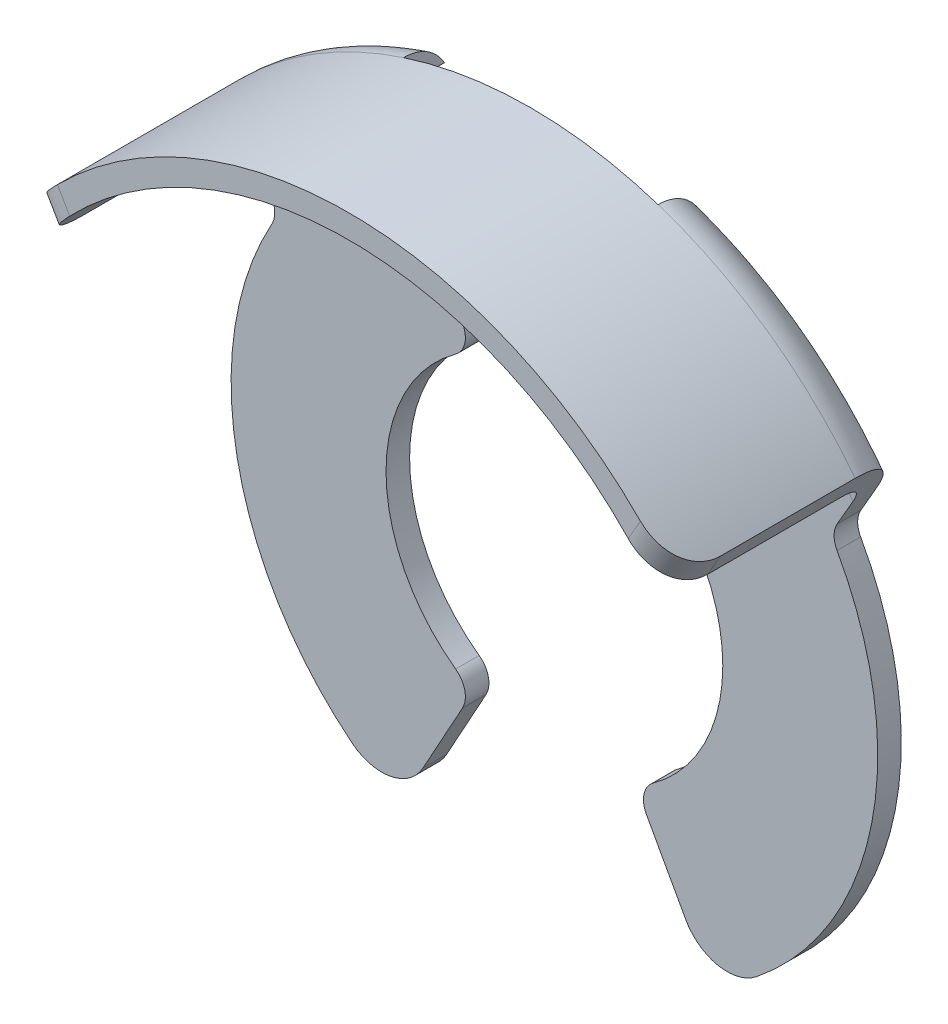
ISO-10303-21;
HEADER;
FILE_DESCRIPTION(('STEP AP214'),'2;1');
FILE_NAME('part.step','',(''),(''),'','','');
FILE_SCHEMA(('AUTOMOTIVE_DESIGN { 1 0 10303 214 1 1 1 1 }'));
ENDSEC;
DATA;
#1=APPLICATION_CONTEXT('core data for automotive mechanical design processes');
#2=APPLICATION_PROTOCOL_DEFINITION('international standard','automotive_design',2000,#1);
#3=PRODUCT_CONTEXT('',#1,'mechanical');
#4=PRODUCT('Part','Part','',(#3));
#5=PRODUCT_RELATED_PRODUCT_CATEGORY('part','',(#4));
#6=PRODUCT_DEFINITION_FORMATION('','',#4);
#7=PRODUCT_DEFINITION_CONTEXT('part definition',#1,'design');
#8=PRODUCT_DEFINITION('design','',#6,#7);
#9=PRODUCT_DEFINITION_SHAPE('','',#8);
#10=(LENGTH_UNIT() NAMED_UNIT(*) SI_UNIT(.MILLI.,.METRE.));
#11=(NAMED_UNIT(*) PLANE_ANGLE_UNIT() SI_UNIT($,.RADIAN.));
#12=(NAMED_UNIT(*) SI_UNIT($,.STERADIAN.) SOLID_ANGLE_UNIT());
#13=UNCERTAINTY_MEASURE_WITH_UNIT(LENGTH_MEASURE(1.E-05),#10,'distance_accuracy_value','');
#14=(GEOMETRIC_REPRESENTATION_CONTEXT(3) GLOBAL_UNCERTAINTY_ASSIGNED_CONTEXT((#13)) GLOBAL_UNIT_ASSIGNED_CONTEXT((#10,
#11,#12)) REPRESENTATION_CONTEXT('',''));
#15=CARTESIAN_POINT('',(0.,0.,0.));
#16=DIRECTION('',(0.,0.,1.));
#17=DIRECTION('',(1.,0.,0.));
#18=AXIS2_PLACEMENT_3D('',#15,#16,#17);
#19=CARTESIAN_POINT('',(0.,0.,-6.1));
#20=DIRECTION('',(0.,0.,1.));
#21=DIRECTION('',(1.,0.,0.));
#22=AXIS2_PLACEMENT_3D('',#19,#20,#21);
#23=CYLINDRICAL_SURFACE('',#22,11.5);
#24=DIRECTION('',(0.,0.,1.));
#25=VECTOR('',#24,1.);
#26=CARTESIAN_POINT('',(3.77968221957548,10.8611234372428,-6.1));
#27=LINE('',#26,#25);
#28=CARTESIAN_POINT('',(3.77968221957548,10.8611234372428,-6.61243556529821));
#29=VERTEX_POINT('',#28);
#30=CARTESIAN_POINT('',(3.77968221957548,10.8611234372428,-5.4));
#31=VERTEX_POINT('',#30);
#32=EDGE_CURVE('E261',#29,#31,#27,.T.);
#33=ORIENTED_EDGE('',*,*,#32,.F.);
#34=CARTESIAN_POINT('',(0.,0.,-6.61243556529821));
#35=DIRECTION('',(0.,0.,1.));
#36=DIRECTION('',(1.,0.,0.));
#37=AXIS2_PLACEMENT_3D('',#34,#35,#36);
#38=CIRCLE('',#37,11.5);
#39=CARTESIAN_POINT('',(4.10187399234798,10.7435855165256,-6.61243556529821));
#40=VERTEX_POINT('',#39);
#41=EDGE_CURVE('E866',#29,#40,#38,.F.);
#42=ORIENTED_EDGE('',*,*,#41,.T.);
#43=DIRECTION('',(0.,0.,1.));
#44=VECTOR('',#43,1.);
#45=CARTESIAN_POINT('',(4.10187399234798,10.7435855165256,-6.8));
#46=LINE('',#45,#44);
#47=CARTESIAN_POINT('',(4.10187399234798,10.7435855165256,-5.4));
#48=VERTEX_POINT('',#47);
#49=EDGE_CURVE('E69',#40,#48,#46,.T.);
#50=ORIENTED_EDGE('',*,*,#49,.T.);
#51=CARTESIAN_POINT('',(0.,0.,-5.4));
#52=DIRECTION('',(0.,0.,1.));
#53=DIRECTION('',(1.,0.,0.));
#54=AXIS2_PLACEMENT_3D('',#51,#52,#53);
#55=CIRCLE('',#54,11.5);
#56=CARTESIAN_POINT('',(9.25185351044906,6.83031526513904,-5.4));
#57=VERTEX_POINT('',#56);
#58=EDGE_CURVE('E604',#48,#57,#55,.F.);
#59=ORIENTED_EDGE('',*,*,#58,.T.);
#60=DIRECTION('',(0.,0.,1.));
#61=VECTOR('',#60,1.);
#62=CARTESIAN_POINT('',(9.25185351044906,6.83031526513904,-6.1));
#63=LINE('',#62,#61);
#64=CARTESIAN_POINT('',(9.25185351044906,6.83031526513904,-1.4));
#65=VERTEX_POINT('',#64);
#66=EDGE_CURVE('E412',#57,#65,#63,.T.);
#67=ORIENTED_EDGE('',*,*,#66,.T.);
#68=CARTESIAN_POINT('',(9.25185351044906,6.83031526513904,-1.4));
#69=CARTESIAN_POINT('',(9.25185381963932,6.83031295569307,-1.36276060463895));
#70=CARTESIAN_POINT('',(9.25089013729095,6.83162037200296,-1.3255402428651));
#71=CARTESIAN_POINT('',(9.24704892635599,6.83681956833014,-1.25138971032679));
#72=CARTESIAN_POINT('',(9.2441719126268,6.84071065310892,-1.21445946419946));
#73=CARTESIAN_POINT('',(9.23272362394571,6.8561642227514,-1.10476162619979));
#74=CARTESIAN_POINT('',(9.22133480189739,6.87150768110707,-1.03276826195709));
#75=CARTESIAN_POINT('',(9.19141254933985,6.91147947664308,-0.893078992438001));
#76=CARTESIAN_POINT('',(9.1728831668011,6.93610255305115,-0.825380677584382));
#77=CARTESIAN_POINT('',(9.12920030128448,6.9934968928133,-0.695793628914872));
#78=CARTESIAN_POINT('',(9.1040427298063,7.02627318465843,-0.63390851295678));
#79=CARTESIAN_POINT('',(9.0465778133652,7.10011973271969,-0.514921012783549));
#80=CARTESIAN_POINT('',(9.01402140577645,7.14147297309,-0.458115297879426));
#81=CARTESIAN_POINT('',(8.94313893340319,7.23004025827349,-0.353359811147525));
#82=CARTESIAN_POINT('',(8.9048107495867,7.27725645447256,-0.305413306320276));
#83=CARTESIAN_POINT('',(8.8201019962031,7.37973811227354,-0.216051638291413));
#84=CARTESIAN_POINT('',(8.77333406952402,7.43534126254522,-0.175390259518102));
#85=CARTESIAN_POINT('',(8.67504181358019,7.54979067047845,-0.106217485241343));
#86=CARTESIAN_POINT('',(8.62351821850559,7.60863642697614,-0.0777042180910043));
#87=CARTESIAN_POINT('',(8.52583156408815,7.71781095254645,-0.0372540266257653));
#88=CARTESIAN_POINT('',(8.48022166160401,7.7679101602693,-0.0233373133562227));
#89=CARTESIAN_POINT('',(8.38729063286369,7.86817083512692,-0.00470544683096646));
#90=CARTESIAN_POINT('',(8.33997055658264,7.91833224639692,1.52578251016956E-05));
#91=CARTESIAN_POINT('',(8.29215606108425,7.96807052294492,0.));
#92=B_SPLINE_CURVE_WITH_KNOTS('',3,(#68,#69,#70,#71,#72,#73,#74,#75,#76,#77,#78,#79,#80,#81,#82,
#83,#84,#85,#86,#87,#88,#89,#90,#91),.UNSPECIFIED.,.F.,.F.,(4,2,2,2,2,2,2,2,2,2,2,4),(0.,
0.111645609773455,0.223261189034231,0.445549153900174,0.667711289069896,0.890010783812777,
1.12134654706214,1.35276745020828,1.60144755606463,1.85008933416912,2.0569691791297,
2.26372409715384),.UNSPECIFIED.);
#93=CARTESIAN_POINT('',(8.29215606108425,7.96807052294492,0.));
#94=VERTEX_POINT('',#93);
#95=EDGE_CURVE('E466',#65,#94,#92,.T.);
#96=ORIENTED_EDGE('',*,*,#95,.T.);
#97=CARTESIAN_POINT('',(0.,0.,0.));
#98=DIRECTION('',(0.,0.,1.));
#99=DIRECTION('',(1.,0.,0.));
#100=AXIS2_PLACEMENT_3D('',#97,#98,#99);
#101=CIRCLE('',#100,11.5);
#102=CARTESIAN_POINT('',(-8.29215606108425,7.96807052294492,0.));
#103=VERTEX_POINT('',#102);
#104=EDGE_CURVE('E398',#94,#103,#101,.T.);
#105=ORIENTED_EDGE('',*,*,#104,.T.);
#106=CARTESIAN_POINT('',(-8.29215606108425,7.96807052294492,0.));
#107=CARTESIAN_POINT('',(-8.35184561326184,7.90600547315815,4.37038774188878E-05));
#108=CARTESIAN_POINT('',(-8.41074992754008,7.84325872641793,-0.00732761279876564));
#109=CARTESIAN_POINT('',(-8.5255227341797,7.71831794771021,-0.0362528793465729));
#110=CARTESIAN_POINT('',(-8.58139294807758,7.65612361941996,-0.0577986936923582));
#111=CARTESIAN_POINT('',(-8.68870254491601,7.5341298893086,-0.114426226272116));
#112=CARTESIAN_POINT('',(-8.74014204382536,7.47433042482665,-0.149507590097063));
#113=CARTESIAN_POINT('',(-8.83741019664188,7.3590662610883,-0.232322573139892));
#114=CARTESIAN_POINT('',(-8.8832386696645,7.30360170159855,-0.280056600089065));
#115=CARTESIAN_POINT('',(-8.96822435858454,7.19899350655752,-0.387144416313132));
#116=CARTESIAN_POINT('',(-9.00737600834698,7.1498551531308,-0.446507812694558));
#117=CARTESIAN_POINT('',(-9.07792061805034,7.06007257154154,-0.575447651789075));
#118=CARTESIAN_POINT('',(-9.10931423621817,7.01942762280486,-0.645023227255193));
#119=CARTESIAN_POINT('',(-9.16197092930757,6.95054527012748,-0.788719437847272));
#120=CARTESIAN_POINT('',(-9.18366854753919,6.92178134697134,-0.862428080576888));
#121=CARTESIAN_POINT('',(-9.2184160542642,6.87543874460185,-1.01514958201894));
#122=CARTESIAN_POINT('',(-9.231481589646,6.85783982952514,-1.09415255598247));
#123=CARTESIAN_POINT('',(-9.2439381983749,6.84102649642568,-1.21165742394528));
#124=CARTESIAN_POINT('',(-9.2469051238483,6.83701406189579,-1.24917286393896));
#125=CARTESIAN_POINT('',(-9.25086141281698,6.83165936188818,-1.32445154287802));
#126=CARTESIAN_POINT('',(-9.25185316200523,6.8303138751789,-1.36221442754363));
#127=CARTESIAN_POINT('',(-9.25185351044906,6.83031526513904,-1.4));
#128=B_SPLINE_CURVE_WITH_KNOTS('',3,(#106,#107,#108,#109,#110,#111,#112,#113,#114,#115,#116,
#117,#118,#119,#120,#121,#122,#123,#124,#125,#126,#127),.UNSPECIFIED.,.F.,.F.,(4,2,2,2,2,2,2,2,
2,2,4),(0.,0.257936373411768,0.515724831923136,0.773506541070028,1.03129655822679,
1.28930044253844,1.54728242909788,1.79212444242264,2.03652141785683,2.14993381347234,
2.26320914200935),.UNSPECIFIED.);
#129=CARTESIAN_POINT('',(-9.25185351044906,6.83031526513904,-1.4));
#130=VERTEX_POINT('',#129);
#131=EDGE_CURVE('E457',#103,#130,#128,.T.);
#132=ORIENTED_EDGE('',*,*,#131,.T.);
#133=DIRECTION('',(0.,0.,1.));
#134=VECTOR('',#133,1.);
#135=CARTESIAN_POINT('',(-9.25185351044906,6.83031526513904,-6.1));
#136=LINE('',#135,#134);
#137=CARTESIAN_POINT('',(-9.25185351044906,6.83031526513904,-5.4));
#138=VERTEX_POINT('',#137);
#139=EDGE_CURVE('E419',#130,#138,#136,.F.);
#140=ORIENTED_EDGE('',*,*,#139,.T.);
#141=CARTESIAN_POINT('',(0.,0.,-5.4));
#142=DIRECTION('',(0.,0.,1.));
#143=DIRECTION('',(1.,0.,0.));
#144=AXIS2_PLACEMENT_3D('',#141,#142,#143);
#145=CIRCLE('',#144,11.5);
#146=CARTESIAN_POINT('',(-4.10187399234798,10.7435855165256,-5.4));
#147=VERTEX_POINT('',#146);
#148=EDGE_CURVE('E600',#138,#147,#145,.F.);
#149=ORIENTED_EDGE('',*,*,#148,.T.);
#150=DIRECTION('',(0.,0.,1.));
#151=VECTOR('',#150,1.);
#152=CARTESIAN_POINT('',(-4.10187399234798,10.7435855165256,-6.8));
#153=LINE('',#152,#151);
#154=CARTESIAN_POINT('',(-4.10187399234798,10.7435855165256,-6.61243556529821));
#155=VERTEX_POINT('',#154);
#156=EDGE_CURVE('E349',#155,#147,#153,.T.);
#157=ORIENTED_EDGE('',*,*,#156,.F.);
#158=CARTESIAN_POINT('',(-3.77968221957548,10.8611234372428,-6.61243556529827));
#159=VERTEX_POINT('',#158);
#160=EDGE_CURVE('E739',#155,#159,#38,.F.);
#161=ORIENTED_EDGE('',*,*,#160,.T.);
#162=DIRECTION('',(0.,0.,1.));
#163=VECTOR('',#162,1.);
#164=CARTESIAN_POINT('',(-3.77968221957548,10.8611234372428,-6.1));
#165=LINE('',#164,#163);
#166=CARTESIAN_POINT('',(-3.77968221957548,10.8611234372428,-5.4));
#167=VERTEX_POINT('',#166);
#168=EDGE_CURVE('E269',#167,#159,#165,.F.);
#169=ORIENTED_EDGE('',*,*,#168,.F.);
#170=CARTESIAN_POINT('',(0.,0.,-5.4));
#171=DIRECTION('',(0.,0.,-1.));
#172=DIRECTION('',(-1.,0.,0.));
#173=AXIS2_PLACEMENT_3D('',#170,#171,#172);
#174=CIRCLE('',#173,11.5);
#175=EDGE_CURVE('E273',#31,#167,#174,.F.);
#176=ORIENTED_EDGE('',*,*,#175,.F.);
#177=EDGE_LOOP('',(#33,#42,#50,#59,#67,#96,#105,#132,#140,#149,#157,#161,#169,#176));
#178=FACE_BOUND('',#177,.T.);
#179=ADVANCED_FACE('F39',(#178),#23,.F.);
#180=CARTESIAN_POINT('',(0.,0.,-5.4));
#181=DIRECTION('',(0.,0.,1.));
#182=DIRECTION('',(1.,0.,0.));
#183=AXIS2_PLACEMENT_3D('',#180,#181,#182);
#184=TOROIDAL_SURFACE('',#183,10.8,1.4);
#185=ORIENTED_EDGE('',*,*,#41,.F.);
#186=CARTESIAN_POINT('',(3.77968221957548,8.98751761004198,-6.32595308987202));
#187=CARTESIAN_POINT('',(3.77968221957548,9.04690269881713,-6.38802541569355));
#188=CARTESIAN_POINT('',(3.77968221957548,9.11186043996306,-6.4448932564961));
#189=CARTESIAN_POINT('',(3.77968221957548,9.25054663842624,-6.54687340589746));
#190=CARTESIAN_POINT('',(3.77968221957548,9.3242941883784,-6.59195941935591));
#191=CARTESIAN_POINT('',(3.77968221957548,9.47796686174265,-6.66927911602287));
#192=CARTESIAN_POINT('',(3.77968221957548,9.55787319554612,-6.7015501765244));
#193=CARTESIAN_POINT('',(3.77968221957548,9.72179041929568,-6.75279500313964));
#194=CARTESIAN_POINT('',(3.77968221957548,9.8057996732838,-6.77177402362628));
#195=CARTESIAN_POINT('',(3.77968221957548,9.97918967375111,-6.79653926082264));
#196=CARTESIAN_POINT('',(3.77968221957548,10.0686507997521,-6.80176668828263));
#197=CARTESIAN_POINT('',(3.77968221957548,10.2472104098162,-6.7971833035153));
#198=CARTESIAN_POINT('',(3.77968221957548,10.3363088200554,-6.78736956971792));
#199=CARTESIAN_POINT('',(3.77968221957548,10.5117712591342,-6.75268998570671));
#200=CARTESIAN_POINT('',(3.77968221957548,10.598128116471,-6.72778761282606));
#201=CARTESIAN_POINT('',(3.77968221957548,10.7651778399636,-6.66327926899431));
#202=CARTESIAN_POINT('',(3.77968221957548,10.8458717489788,-6.62367601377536));
#203=CARTESIAN_POINT('',(3.77968221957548,10.9959687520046,-6.53235721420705));
#204=CARTESIAN_POINT('',(3.77968221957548,11.06568204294,-6.4811523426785));
#205=CARTESIAN_POINT('',(3.77968221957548,11.194871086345,-6.36713093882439));
#206=CARTESIAN_POINT('',(3.77968221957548,11.2543503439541,-6.30431839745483));
#207=CARTESIAN_POINT('',(3.77968221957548,11.3578286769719,-6.17263498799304));
#208=CARTESIAN_POINT('',(3.77968221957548,11.4025057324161,-6.1042968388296));
#209=CARTESIAN_POINT('',(3.77968221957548,11.4790461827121,-5.96078453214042));
#210=CARTESIAN_POINT('',(3.77968221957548,11.5109137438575,-5.88561260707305));
#211=CARTESIAN_POINT('',(3.77968221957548,11.5593453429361,-5.73462638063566));
#212=CARTESIAN_POINT('',(3.77968221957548,11.5765931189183,-5.6590309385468));
#213=CARTESIAN_POINT('',(3.77968221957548,11.5977558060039,-5.50599978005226));
#214=CARTESIAN_POINT('',(3.77968221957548,11.6016733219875,-5.42856442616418));
#215=CARTESIAN_POINT('',(3.77968221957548,11.5961102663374,-5.27630460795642));
#216=CARTESIAN_POINT('',(3.77968221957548,11.5869925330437,-5.20146657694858));
#217=CARTESIAN_POINT('',(3.77968221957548,11.5563381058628,-5.0543856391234));
#218=CARTESIAN_POINT('',(3.77968221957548,11.5348018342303,-4.98214264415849));
#219=CARTESIAN_POINT('',(3.77968221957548,11.4800108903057,-4.84210792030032));
#220=CARTESIAN_POINT('',(3.77968221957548,11.4467352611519,-4.77432441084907));
#221=CARTESIAN_POINT('',(3.77968221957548,11.3695827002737,-4.64509626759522));
#222=CARTESIAN_POINT('',(3.77968221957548,11.3257046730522,-4.58365228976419));
#223=CARTESIAN_POINT('',(3.77968221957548,11.2273101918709,-4.4668874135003));
#224=CARTESIAN_POINT('',(3.77968221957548,11.1725223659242,-4.41179547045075));
#225=CARTESIAN_POINT('',(3.77968221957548,11.0548500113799,-4.31108427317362));
#226=CARTESIAN_POINT('',(3.77968221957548,10.9919638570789,-4.26546692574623));
#227=CARTESIAN_POINT('',(3.77968221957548,10.8566829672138,-4.18264230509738));
#228=CARTESIAN_POINT('',(3.77968221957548,10.7839765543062,-4.1459443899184));
#229=CARTESIAN_POINT('',(3.77968221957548,10.6336614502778,-4.08456777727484));
#230=CARTESIAN_POINT('',(3.77968221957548,10.5560515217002,-4.05989212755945));
#231=CARTESIAN_POINT('',(3.77968221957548,10.3936836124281,-4.0219041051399));
#232=CARTESIAN_POINT('',(3.77968221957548,10.3087657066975,-4.00927453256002));
#233=CARTESIAN_POINT('',(3.77968221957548,10.138001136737,-3.99783525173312));
#234=CARTESIAN_POINT('',(3.77968221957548,10.0521542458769,-3.99902899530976));
#235=CARTESIAN_POINT('',(3.77968221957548,9.87823864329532,-4.01542665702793));
#236=CARTESIAN_POINT('',(3.77968221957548,9.79022349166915,-4.03120398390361));
#237=CARTESIAN_POINT('',(3.77968221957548,9.61803152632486,-4.07719584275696));
#238=CARTESIAN_POINT('',(3.77968221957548,9.53385530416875,-4.10741259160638));
#239=CARTESIAN_POINT('',(3.77968221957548,9.37127179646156,-4.18190825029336));
#240=CARTESIAN_POINT('',(3.77968221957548,9.29290645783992,-4.22627906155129));
#241=CARTESIAN_POINT('',(3.77968221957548,9.14515772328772,-4.3280978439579));
#242=CARTESIAN_POINT('',(3.77968221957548,9.07577290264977,-4.38554373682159));
#243=CARTESIAN_POINT('',(3.77968221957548,8.95136147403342,-4.50945709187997));
#244=CARTESIAN_POINT('',(3.77968221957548,8.89584836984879,-4.57543474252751));
#245=CARTESIAN_POINT('',(3.77968221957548,8.79783539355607,-4.71644494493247));
#246=CARTESIAN_POINT('',(3.77968221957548,8.75532781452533,-4.79147209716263));
#247=CARTESIAN_POINT('',(3.77968221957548,8.68819181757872,-4.94202444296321));
#248=CARTESIAN_POINT('',(3.77968221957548,8.66241028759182,-5.01703543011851));
#249=CARTESIAN_POINT('',(3.77968221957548,8.62487607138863,-5.17047888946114));
#250=CARTESIAN_POINT('',(3.77968221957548,8.61311541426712,-5.24890939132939));
#251=CARTESIAN_POINT('',(3.77968221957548,8.60452168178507,-5.40108092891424));
#252=CARTESIAN_POINT('',(3.77968221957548,8.60670593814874,-5.47476810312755));
#253=CARTESIAN_POINT('',(3.77968221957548,8.62361818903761,-5.62070209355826));
#254=CARTESIAN_POINT('',(3.77968221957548,8.6383482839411,-5.69294866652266));
#255=CARTESIAN_POINT('',(3.77968221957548,8.67941214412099,-5.83296723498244));
#256=CARTESIAN_POINT('',(3.77968221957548,8.7055856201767,-5.90078667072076));
#257=CARTESIAN_POINT('',(3.77968221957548,8.76844472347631,-6.03128036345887));
#258=CARTESIAN_POINT('',(3.77968221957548,8.80511846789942,-6.09396033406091));
#259=CARTESIAN_POINT('',(3.77968221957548,8.86758961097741,-6.18394661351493));
#260=CARTESIAN_POINT('',(3.77968221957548,8.8900201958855,-6.21364953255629));
#261=CARTESIAN_POINT('',(3.77968221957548,8.93712481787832,-6.27121124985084));
#262=CARTESIAN_POINT('',(3.77968221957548,8.96179859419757,-6.29907026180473));
#263=CARTESIAN_POINT('',(3.77968221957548,8.98751761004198,-6.32595308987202));
#264=B_SPLINE_CURVE_WITH_KNOTS('',3,(#186,#187,#188,#189,#190,#191,#192,#193,#194,#195,#196,
#197,#198,#199,#200,#201,#202,#203,#204,#205,#206,#207,#208,#209,#210,#211,#212,#213,#214,#215,
#216,#217,#218,#219,#220,#221,#222,#223,#224,#225,#226,#227,#228,#229,#230,#231,#232,#233,#234,
#235,#236,#237,#238,#239,#240,#241,#242,#243,#244,#245,#246,#247,#248,#249,#250,#251,#252,#253,
#254,#255,#256,#257,#258,#259,#260,#261,#262,#263),.UNSPECIFIED.,.T.,.F.,(4,2,2,2,2,2,2,2,2,2,2,
2,2,2,2,2,2,2,2,2,2,2,2,2,2,2,2,2,2,2,2,2,2,2,2,2,2,2,4),(0.,0.257568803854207,
0.515707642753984,0.773087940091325,1.030366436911,1.29794850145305,1.56558254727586,
1.8338670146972,2.102101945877,2.36026437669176,2.61833821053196,2.86202952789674,
3.10564152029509,3.33710847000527,3.56853018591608,3.79363426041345,4.01873068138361,
4.24423099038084,4.46975460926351,4.70181169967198,4.93391544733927,5.17717055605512,
5.42048730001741,5.67689506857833,5.93336686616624,6.20037241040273,6.46741896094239,
6.73623598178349,7.00501030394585,7.26231085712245,7.51945864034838,7.75615444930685,
7.99271563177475,8.21280006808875,8.43292135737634,8.65005349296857,8.86694087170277,
8.97850398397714,9.09005414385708),.UNSPECIFIED.);
#265=CARTESIAN_POINT('',(3.77968221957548,11.5997414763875,-5.4));
#266=VERTEX_POINT('',#265);
#267=EDGE_CURVE('E11',#29,#266,#264,.T.);
#268=ORIENTED_EDGE('',*,*,#267,.T.);
#269=CARTESIAN_POINT('',(0.,0.,-5.4));
#270=DIRECTION('',(0.,0.,1.));
#271=DIRECTION('',(1.,0.,0.));
#272=AXIS2_PLACEMENT_3D('',#269,#270,#271);
#273=CIRCLE('',#272,12.2);
#274=CARTESIAN_POINT('',(9.63162890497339,7.4881055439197,-5.4));
#275=VERTEX_POINT('',#274);
#276=EDGE_CURVE('E793',#275,#266,#273,.T.);
#277=ORIENTED_EDGE('',*,*,#276,.F.);
#278=CARTESIAN_POINT('',(8.86763319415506,6.16482615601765,-6.8));
#279=CARTESIAN_POINT('',(8.913930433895,6.24501532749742,-6.80004613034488));
#280=CARTESIAN_POINT('',(8.96026099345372,6.32526221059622,-6.79247829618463));
#281=CARTESIAN_POINT('',(9.05179301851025,6.48380032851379,-6.76212138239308));
#282=CARTESIAN_POINT('',(9.09699076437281,6.56208512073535,-6.73928762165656));
#283=CARTESIAN_POINT('',(9.18486491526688,6.71428761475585,-6.67834236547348));
#284=CARTESIAN_POINT('',(9.22753587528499,6.78819588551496,-6.64019916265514));
#285=CARTESIAN_POINT('',(9.30871787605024,6.92880723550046,-6.54922169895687));
#286=CARTESIAN_POINT('',(9.34723463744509,6.99552022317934,-6.49640800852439));
#287=CARTESIAN_POINT('',(9.41635645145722,7.11524271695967,-6.38099105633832));
#288=CARTESIAN_POINT('',(9.44730810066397,7.16885254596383,-6.31921973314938));
#289=CARTESIAN_POINT('',(9.50300564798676,7.26532352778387,-6.18527836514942));
#290=CARTESIAN_POINT('',(9.52775183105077,7.30818517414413,-6.1131087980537));
#291=CARTESIAN_POINT('',(9.56808876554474,7.37805079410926,-5.96715178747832));
#292=CARTESIAN_POINT('',(9.58427980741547,7.40609450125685,-5.89402573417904));
#293=CARTESIAN_POINT('',(9.60980184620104,7.4502999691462,-5.74319570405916));
#294=CARTESIAN_POINT('',(9.61914544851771,7.46648356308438,-5.66550042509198));
#295=CARTESIAN_POINT('',(9.62711928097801,7.48029464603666,-5.55589909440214));
#296=CARTESIAN_POINT('',(9.62881033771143,7.48322364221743,-5.52479066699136));
#297=CARTESIAN_POINT('',(9.63106386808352,7.48712687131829,-5.46246021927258));
#298=CARTESIAN_POINT('',(9.63162812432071,7.48810419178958,-5.43123845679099));
#299=CARTESIAN_POINT('',(9.63162890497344,7.48810554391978,-5.40000000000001));
#300=B_SPLINE_CURVE_WITH_KNOTS('',3,(#278,#279,#280,#281,#282,#283,#284,#285,#286,#287,#288,
#289,#290,#291,#292,#293,#294,#295,#296,#297,#298,#299),.UNSPECIFIED.,.F.,.F.,(4,2,2,2,2,2,2,2,
2,2,4),(0.,0.27758120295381,0.5559784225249,0.834955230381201,1.11354282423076,1.37448500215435,
1.63541519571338,1.87412041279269,2.11238508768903,2.2061954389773,2.29985726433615),.UNSPECIFIED.);
#301=CARTESIAN_POINT('',(8.86763319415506,6.16482615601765,-6.8));
#302=VERTEX_POINT('',#301);
#303=EDGE_CURVE('E527',#302,#275,#300,.T.);
#304=ORIENTED_EDGE('',*,*,#303,.F.);
#305=CARTESIAN_POINT('',(0.,0.,-6.8));
#306=DIRECTION('',(0.,0.,1.));
#307=DIRECTION('',(1.,0.,0.));
#308=AXIS2_PLACEMENT_3D('',#305,#306,#307);
#309=CIRCLE('',#308,10.8);
#310=CARTESIAN_POINT('',(4.99554465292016,9.57520410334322,-6.8));
#311=VERTEX_POINT('',#310);
#312=EDGE_CURVE('E742',#311,#302,#309,.F.);
#313=ORIENTED_EDGE('',*,*,#312,.F.);
#314=CARTESIAN_POINT('',(4.10187399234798,10.7435855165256,-6.61243556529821));
#315=CARTESIAN_POINT('',(4.13709900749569,10.7301434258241,-6.61242098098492));
#316=CARTESIAN_POINT('',(4.17177011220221,10.7152693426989,-6.61320750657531));
#317=CARTESIAN_POINT('',(4.23972743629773,10.6828167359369,-6.61627339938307));
#318=CARTESIAN_POINT('',(4.27301453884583,10.6652399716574,-6.61855179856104));
#319=CARTESIAN_POINT('',(4.33779035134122,10.6276298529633,-6.62447560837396));
#320=CARTESIAN_POINT('',(4.36928812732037,10.6076108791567,-6.62811325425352));
#321=CARTESIAN_POINT('',(4.43047865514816,10.5652121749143,-6.63655944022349));
#322=CARTESIAN_POINT('',(4.46017117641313,10.5428321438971,-6.64136812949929));
#323=CARTESIAN_POINT('',(4.54613995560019,10.4725107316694,-6.65718006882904));
#324=CARTESIAN_POINT('',(4.59951286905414,10.4212679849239,-6.66959056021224));
#325=CARTESIAN_POINT('',(4.69747266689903,10.3111822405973,-6.69597866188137));
#326=CARTESIAN_POINT('',(4.74203811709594,10.2523212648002,-6.70995996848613));
#327=CARTESIAN_POINT('',(4.82434222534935,10.1236985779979,-6.73805864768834));
#328=CARTESIAN_POINT('',(4.86135573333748,10.0534566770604,-6.75211297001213));
#329=CARTESIAN_POINT('',(4.92307161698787,9.9072488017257,-6.77613374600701));
#330=CARTESIAN_POINT('',(4.94781395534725,9.83130234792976,-6.78611345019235));
#331=CARTESIAN_POINT('',(4.97277589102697,9.72428394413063,-6.79486788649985));
#332=CARTESIAN_POINT('',(4.97867226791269,9.6947137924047,-6.79675035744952));
#333=CARTESIAN_POINT('',(4.9885512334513,9.63520344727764,-6.79931630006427));
#334=CARTESIAN_POINT('',(4.99253370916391,9.6052632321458,-6.79999970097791));
#335=CARTESIAN_POINT('',(4.99554465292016,9.57520410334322,-6.8));
#336=B_SPLINE_CURVE_WITH_KNOTS('',3,(#314,#315,#316,#317,#318,#319,#320,#321,#322,#323,#324,
#325,#326,#327,#328,#329,#330,#331,#332,#333,#334,#335),.UNSPECIFIED.,.F.,.F.,(4,2,2,2,2,2,2,2,
2,2,4),(0.,0.113057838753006,0.226042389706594,0.338391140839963,0.4507542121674,
0.674772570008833,0.89932957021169,1.14009862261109,1.38007834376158,1.47063953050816,
1.5612060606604),.UNSPECIFIED.);
#337=EDGE_CURVE('E791',#40,#311,#336,.T.);
#338=ORIENTED_EDGE('',*,*,#337,.F.);
#339=EDGE_LOOP('',(#185,#268,#277,#304,#313,#338));
#340=FACE_BOUND('',#339,.T.);
#341=ADVANCED_FACE('F483',(#340),#184,.T.);
#342=CARTESIAN_POINT('',(-3.77968221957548,11.5997414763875,-5.4));
#343=VERTEX_POINT('',#342);
#344=CARTESIAN_POINT('',(-9.63162890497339,7.4881055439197,-5.4));
#345=VERTEX_POINT('',#344);
#346=EDGE_CURVE('E842',#343,#345,#273,.T.);
#347=ORIENTED_EDGE('',*,*,#346,.F.);
#348=CARTESIAN_POINT('',(-3.77968221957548,8.98751761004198,-6.32595308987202));
#349=CARTESIAN_POINT('',(-3.77968221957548,8.93434210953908,-6.27036399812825));
#350=CARTESIAN_POINT('',(-3.77968221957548,8.88556068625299,-6.21052992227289));
#351=CARTESIAN_POINT('',(-3.77968221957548,8.79847209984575,-6.08361709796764));
#352=CARTESIAN_POINT('',(-3.77968221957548,8.760168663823,-6.01653578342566));
#353=CARTESIAN_POINT('',(-3.77968221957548,8.69549174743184,-5.87659926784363));
#354=CARTESIAN_POINT('',(-3.77968221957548,8.66915051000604,-5.80372907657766));
#355=CARTESIAN_POINT('',(-3.77968221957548,8.62976351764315,-5.65448354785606));
#356=CARTESIAN_POINT('',(-3.77968221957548,8.61671309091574,-5.57810945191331));
#357=CARTESIAN_POINT('',(-3.77968221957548,8.6048143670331,-5.42778577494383));
#358=CARTESIAN_POINT('',(-3.77968221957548,8.60534404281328,-5.3538849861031));
#359=CARTESIAN_POINT('',(-3.77968221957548,8.61905221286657,-5.20727491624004));
#360=CARTESIAN_POINT('',(-3.77968221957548,8.63222952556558,-5.13456552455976));
#361=CARTESIAN_POINT('',(-3.77968221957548,8.67030159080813,-4.99366406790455));
#362=CARTESIAN_POINT('',(-3.77968221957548,8.69498824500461,-4.92541537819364));
#363=CARTESIAN_POINT('',(-3.77968221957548,8.75500898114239,-4.79378618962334));
#364=CARTESIAN_POINT('',(-3.77968221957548,8.7903446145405,-4.73040640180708));
#365=CARTESIAN_POINT('',(-3.77968221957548,8.87213221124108,-4.60732564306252));
#366=CARTESIAN_POINT('',(-3.77968221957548,8.91899568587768,-4.54789874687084));
#367=CARTESIAN_POINT('',(-3.77968221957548,9.02138480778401,-4.43705829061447));
#368=CARTESIAN_POINT('',(-3.77968221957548,9.07691315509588,-4.38564723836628));
#369=CARTESIAN_POINT('',(-3.77968221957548,9.19953837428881,-4.28816899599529));
#370=CARTESIAN_POINT('',(-3.77968221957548,9.26719354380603,-4.24280413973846));
#371=CARTESIAN_POINT('',(-3.77968221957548,9.40875860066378,-4.16320101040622));
#372=CARTESIAN_POINT('',(-3.77968221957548,9.48267062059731,-4.12896655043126));
#373=CARTESIAN_POINT('',(-3.77968221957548,9.64021071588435,-4.07021896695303));
#374=CARTESIAN_POINT('',(-3.77968221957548,9.72415666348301,-4.04655595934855));
#375=CARTESIAN_POINT('',(-3.77968221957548,9.89478079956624,-4.01313975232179));
#376=CARTESIAN_POINT('',(-3.77968221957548,9.98145962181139,-4.00338980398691));
#377=CARTESIAN_POINT('',(-3.77968221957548,10.1581819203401,-3.998004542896));
#378=CARTESIAN_POINT('',(-3.77968221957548,10.2482407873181,-4.0028533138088));
#379=CARTESIAN_POINT('',(-3.77968221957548,10.426237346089,-4.02779280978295));
#380=CARTESIAN_POINT('',(-3.77968221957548,10.514175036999,-4.04788354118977));
#381=CARTESIAN_POINT('',(-3.77968221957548,10.684146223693,-4.1026908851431));
#382=CARTESIAN_POINT('',(-3.77968221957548,10.766240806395,-4.13721732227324));
#383=CARTESIAN_POINT('',(-3.77968221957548,10.9230641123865,-4.22021469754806));
#384=CARTESIAN_POINT('',(-3.77968221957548,10.9977946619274,-4.2686821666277));
#385=CARTESIAN_POINT('',(-3.77968221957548,11.1339740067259,-4.37584088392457));
#386=CARTESIAN_POINT('',(-3.77968221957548,11.1958786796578,-4.43395224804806));
#387=CARTESIAN_POINT('',(-3.77968221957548,11.3083338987,-4.5602894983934));
#388=CARTESIAN_POINT('',(-3.77968221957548,11.3588884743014,-4.62851178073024));
#389=CARTESIAN_POINT('',(-3.77968221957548,11.4442052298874,-4.76898318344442));
#390=CARTESIAN_POINT('',(-3.77968221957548,11.4796953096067,-4.8407904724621));
#391=CARTESIAN_POINT('',(-3.77968221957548,11.5374842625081,-4.9895298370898));
#392=CARTESIAN_POINT('',(-3.77968221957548,11.5597869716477,-5.06646041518));
#393=CARTESIAN_POINT('',(-3.77968221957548,11.5896678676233,-5.21963751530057));
#394=CARTESIAN_POINT('',(-3.77968221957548,11.5978459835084,-5.29576746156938));
#395=CARTESIAN_POINT('',(-3.77968221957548,11.601049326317,-5.44829889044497));
#396=CARTESIAN_POINT('',(-3.77968221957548,11.5960763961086,-5.52470033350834));
#397=CARTESIAN_POINT('',(-3.77968221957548,11.5733696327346,-5.67418191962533));
#398=CARTESIAN_POINT('',(-3.77968221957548,11.5558642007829,-5.74729695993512));
#399=CARTESIAN_POINT('',(-3.77968221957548,11.5089613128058,-5.88959962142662));
#400=CARTESIAN_POINT('',(-3.77968221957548,11.4795636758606,-5.95878718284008));
#401=CARTESIAN_POINT('',(-3.77968221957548,11.4094625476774,-6.09218248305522));
#402=CARTESIAN_POINT('',(-3.77968221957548,11.3686330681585,-6.15632389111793));
#403=CARTESIAN_POINT('',(-3.77968221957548,11.2771410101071,-6.27715042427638));
#404=CARTESIAN_POINT('',(-3.77968221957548,11.2264770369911,-6.33383448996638));
#405=CARTESIAN_POINT('',(-3.77968221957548,11.1148342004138,-6.44039893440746));
#406=CARTESIAN_POINT('',(-3.77968221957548,11.0535460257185,-6.48995494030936));
#407=CARTESIAN_POINT('',(-3.77968221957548,10.9238655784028,-6.57866972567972));
#408=CARTESIAN_POINT('',(-3.77968221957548,10.8554716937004,-6.61782613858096));
#409=CARTESIAN_POINT('',(-3.77968221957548,10.7097620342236,-6.68678801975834));
#410=CARTESIAN_POINT('',(-3.77968221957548,10.6321677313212,-6.7160048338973));
#411=CARTESIAN_POINT('',(-3.77968221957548,10.4733238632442,-6.76171453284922));
#412=CARTESIAN_POINT('',(-3.77968221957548,10.3920734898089,-6.77820458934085));
#413=CARTESIAN_POINT('',(-3.77968221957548,10.2237445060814,-6.79881116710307));
#414=CARTESIAN_POINT('',(-3.77968221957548,10.1365818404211,-6.80224340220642));
#415=CARTESIAN_POINT('',(-3.77968221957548,9.96282672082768,-6.79491758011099));
#416=CARTESIAN_POINT('',(-3.77968221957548,9.87623454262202,-6.78415310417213));
#417=CARTESIAN_POINT('',(-3.77968221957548,9.70317847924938,-6.74815356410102));
#418=CARTESIAN_POINT('',(-3.77968221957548,9.61680928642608,-6.72246183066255));
#419=CARTESIAN_POINT('',(-3.77968221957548,9.44971514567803,-6.6568332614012));
#420=CARTESIAN_POINT('',(-3.77968221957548,9.3689847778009,-6.61691033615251));
#421=CARTESIAN_POINT('',(-3.77968221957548,9.23654937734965,-6.53637468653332));
#422=CARTESIAN_POINT('',(-3.77968221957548,9.18291690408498,-6.49889525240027));
#423=CARTESIAN_POINT('',(-3.77968221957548,9.08097372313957,-6.41728070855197));
#424=CARTESIAN_POINT('',(-3.77968221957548,9.032662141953,-6.37314669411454));
#425=CARTESIAN_POINT('',(-3.77968221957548,8.98751761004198,-6.32595308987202));
#426=B_SPLINE_CURVE_WITH_KNOTS('',3,(#348,#349,#350,#351,#352,#353,#354,#355,#356,#357,#358,
#359,#360,#361,#362,#363,#364,#365,#366,#367,#368,#369,#370,#371,#372,#373,#374,#375,#376,#377,
#378,#379,#380,#381,#382,#383,#384,#385,#386,#387,#388,#389,#390,#391,#392,#393,#394,#395,#396,
#397,#398,#399,#400,#401,#402,#403,#404,#405,#406,#407,#408,#409,#410,#411,#412,#413,#414,#415,
#416,#417,#418,#419,#420,#421,#422,#423,#424,#425),.UNSPECIFIED.,.T.,.F.,(4,2,2,2,2,2,2,2,2,2,2,
2,2,2,2,2,2,2,2,2,2,2,2,2,2,2,2,2,2,2,2,2,2,2,2,2,2,2,4),(0.,0.230569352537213,
0.461220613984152,0.69248993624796,0.923677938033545,1.14429628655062,1.36489402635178,
1.58164928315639,1.79843613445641,2.02451383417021,2.25066212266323,2.49398479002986,
2.73739072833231,2.99786649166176,3.25840311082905,3.52767302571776,3.79694305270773,
4.06277224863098,4.32853535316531,4.58194625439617,4.83526704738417,5.07435019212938,
5.31336375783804,5.54195003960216,5.77050429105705,5.99499590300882,6.21949093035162,
6.4465646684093,6.67367063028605,6.90907676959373,7.14453643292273,7.39217901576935,
7.63987661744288,7.90038895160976,8.16101911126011,8.43007708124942,8.69887277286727,
8.89465197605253,9.09039899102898),.UNSPECIFIED.);
#427=EDGE_CURVE('E54',#343,#159,#426,.T.);
#428=ORIENTED_EDGE('',*,*,#427,.T.);
#429=ORIENTED_EDGE('',*,*,#160,.F.);
#430=CARTESIAN_POINT('',(-4.99554465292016,9.57520410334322,-6.8));
#431=CARTESIAN_POINT('',(-4.99179689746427,9.61265246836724,-6.80000041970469));
#432=CARTESIAN_POINT('',(-4.98653556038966,9.64991384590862,-6.79893915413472));
#433=CARTESIAN_POINT('',(-4.97306565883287,9.72376423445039,-6.79502308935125));
#434=CARTESIAN_POINT('',(-4.96486037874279,9.76035394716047,-6.79217028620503));
#435=CARTESIAN_POINT('',(-4.93604666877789,9.86835857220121,-6.78145729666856));
#436=CARTESIAN_POINT('',(-4.91119332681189,9.93846528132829,-6.77143453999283));
#437=CARTESIAN_POINT('',(-4.85115248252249,10.0731131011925,-6.74825036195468));
#438=CARTESIAN_POINT('',(-4.81600454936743,10.1376743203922,-6.73510099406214));
#439=CARTESIAN_POINT('',(-4.73607148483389,10.2605525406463,-6.70805151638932));
#440=CARTESIAN_POINT('',(-4.69126611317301,10.3188560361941,-6.69414987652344));
#441=CARTESIAN_POINT('',(-4.58863872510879,10.432628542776,-6.66685366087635));
#442=CARTESIAN_POINT('',(-4.53003053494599,10.4874271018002,-6.65360448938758));
#443=CARTESIAN_POINT('',(-4.40382737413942,10.5864486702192,-6.6318718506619));
#444=CARTESIAN_POINT('',(-4.33625808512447,10.6307009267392,-6.62337511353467));
#445=CARTESIAN_POINT('',(-4.23890890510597,10.6830305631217,-6.61631676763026));
#446=CARTESIAN_POINT('',(-4.21206142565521,10.6963668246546,-6.61486712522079));
#447=CARTESIAN_POINT('',(-4.15755308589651,10.7212945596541,-6.61292585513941));
#448=CARTESIAN_POINT('',(-4.12989268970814,10.732887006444,-6.61243369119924));
#449=CARTESIAN_POINT('',(-4.10187399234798,10.7435855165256,-6.61243556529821));
#450=B_SPLINE_CURVE_WITH_KNOTS('',3,(#430,#431,#432,#433,#434,#435,#436,#437,#438,#439,#440,
#441,#442,#443,#444,#445,#446,#447,#448,#449),.UNSPECIFIED.,.F.,.F.,(4,2,2,2,2,2,2,2,2,4),(0.,
0.112800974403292,0.225476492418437,0.449471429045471,0.67261645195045,0.896233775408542,
1.13900337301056,1.38109167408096,1.47106676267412,1.56099144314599),.UNSPECIFIED.);
#451=CARTESIAN_POINT('',(-4.99554465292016,9.57520410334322,-6.8));
#452=VERTEX_POINT('',#451);
#453=EDGE_CURVE('E467',#452,#155,#450,.T.);
#454=ORIENTED_EDGE('',*,*,#453,.F.);
#455=CARTESIAN_POINT('',(0.,0.,-6.8));
#456=DIRECTION('',(0.,0.,1.));
#457=DIRECTION('',(1.,0.,0.));
#458=AXIS2_PLACEMENT_3D('',#455,#456,#457);
#459=CIRCLE('',#458,10.8);
#460=CARTESIAN_POINT('',(-8.86763319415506,6.16482615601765,-6.8));
#461=VERTEX_POINT('',#460);
#462=EDGE_CURVE('E738',#461,#452,#459,.F.);
#463=ORIENTED_EDGE('',*,*,#462,.F.);
#464=CARTESIAN_POINT('',(-9.63162890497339,7.4881055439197,-5.4));
#465=CARTESIAN_POINT('',(-9.63162943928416,7.4881064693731,-5.43722177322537));
#466=CARTESIAN_POINT('',(-9.63082707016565,7.48671672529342,-5.4744249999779));
#467=CARTESIAN_POINT('',(-9.62763061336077,7.48118029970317,-5.54855019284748));
#468=CARTESIAN_POINT('',(-9.62523681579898,7.4770341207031,-5.58547220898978));
#469=CARTESIAN_POINT('',(-9.61571114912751,7.46053518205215,-5.69521512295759));
#470=CARTESIAN_POINT('',(-9.60623477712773,7.44412162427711,-5.76727561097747));
#471=CARTESIAN_POINT('',(-9.58139499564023,7.40109786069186,-5.90714462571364));
#472=CARTESIAN_POINT('',(-9.56603257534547,7.3744893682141,-5.97495386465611));
#473=CARTESIAN_POINT('',(-9.52998046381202,7.31204527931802,-6.10466638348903));
#474=CARTESIAN_POINT('',(-9.50928889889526,7.27620643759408,-6.16656757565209));
#475=CARTESIAN_POINT('',(-9.46263626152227,7.19540169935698,-6.28465932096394));
#476=CARTESIAN_POINT('',(-9.43654434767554,7.15020917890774,-6.34064252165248));
#477=CARTESIAN_POINT('',(-9.3803082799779,7.05280545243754,-6.44374351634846));
#478=CARTESIAN_POINT('',(-9.35016340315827,7.00059299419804,-6.49085972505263));
#479=CARTESIAN_POINT('',(-9.28445765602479,6.88678730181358,-6.57842669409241));
#480=CARTESIAN_POINT('',(-9.24866561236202,6.82479366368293,-6.61818260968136));
#481=CARTESIAN_POINT('',(-9.17442433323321,6.69620399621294,-6.68616249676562));
#482=CARTESIAN_POINT('',(-9.13597322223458,6.62960471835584,-6.71437822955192));
#483=CARTESIAN_POINT('',(-9.05946220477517,6.49708374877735,-6.75784129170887));
#484=CARTESIAN_POINT('',(-9.02148650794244,6.43130791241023,-6.77368829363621));
#485=CARTESIAN_POINT('',(-8.94487976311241,6.29862113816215,-6.79476666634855));
#486=CARTESIAN_POINT('',(-8.90625015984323,6.23171270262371,-6.80001897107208));
#487=CARTESIAN_POINT('',(-8.86763319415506,6.16482615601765,-6.8));
#488=B_SPLINE_CURVE_WITH_KNOTS('',3,(#464,#465,#466,#467,#468,#469,#470,#471,#472,#473,#474,
#475,#476,#477,#478,#479,#480,#481,#482,#483,#484,#485,#486,#487),.UNSPECIFIED.,.F.,.F.,(4,2,2,
2,2,2,2,2,2,2,2,4),(0.,0.111594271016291,0.223168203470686,0.445538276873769,0.66787099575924,
0.890281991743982,1.11889439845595,1.34754763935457,1.59216164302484,1.8369499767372,
2.06896999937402,2.3005311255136),.UNSPECIFIED.);
#489=EDGE_CURVE('E745',#345,#461,#488,.T.);
#490=ORIENTED_EDGE('',*,*,#489,.F.);
#491=EDGE_LOOP('',(#347,#428,#429,#454,#463,#490));
#492=FACE_BOUND('',#491,.T.);
#493=ADVANCED_FACE('F736',(#492),#184,.T.);
#494=CARTESIAN_POINT('',(0.,0.,-6.8));
#495=DIRECTION('',(0.,0.,1.));
#496=DIRECTION('',(1.,0.,0.));
#497=AXIS2_PLACEMENT_3D('',#494,#495,#496);
#498=PLANE('',#497);
#499=CARTESIAN_POINT('',(0.,0.,-6.8));
#500=DIRECTION('',(0.,0.,1.));
#501=DIRECTION('',(1.,0.,0.));
#502=AXIS2_PLACEMENT_3D('',#499,#500,#501);
#503=CIRCLE('',#502,5.);
#504=CARTESIAN_POINT('',(-2.93316984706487,4.04926100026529,-6.8));
#505=VERTEX_POINT('',#504);
#506=CARTESIAN_POINT('',(-2.93316984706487,-4.04926100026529,-6.8));
#507=VERTEX_POINT('',#506);
#508=EDGE_CURVE('E403',#505,#507,#503,.T.);
#509=ORIENTED_EDGE('',*,*,#508,.T.);
#510=CARTESIAN_POINT('',(-3.34381362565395,-4.61615754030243,-6.8));
#511=DIRECTION('',(0.,0.,1.));
#512=DIRECTION('',(1.,0.,0.));
#513=AXIS2_PLACEMENT_3D('',#510,#511,#512);
#514=CIRCLE('',#513,0.7);
#515=CARTESIAN_POINT('',(-2.73077823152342,-4.95407410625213,-6.8));
#516=VERTEX_POINT('',#515);
#517=EDGE_CURVE('E589',#507,#516,#514,.F.);
#518=ORIENTED_EDGE('',*,*,#517,.T.);
#519=DIRECTION('',(-0.482737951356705,-0.875764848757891,0.));
#520=VECTOR('',#519,1.);
#521=CARTESIAN_POINT('',(-2.41368975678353,-4.37882424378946,-6.8));
#522=LINE('',#521,#520);
#523=CARTESIAN_POINT('',(-3.90033145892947,-7.07583313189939,-6.8));
#524=VERTEX_POINT('',#523);
#525=EDGE_CURVE('E289',#516,#524,#522,.T.);
#526=ORIENTED_EDGE('',*,*,#525,.T.);
#527=CARTESIAN_POINT('',(-5.12640224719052,-6.4,-6.8));
#528=DIRECTION('',(0.,0.,-1.));
#529=DIRECTION('',(-1.,0.,0.));
#530=AXIS2_PLACEMENT_3D('',#527,#528,#529);
#531=CIRCLE('',#530,1.4);
#532=CARTESIAN_POINT('',(-6.00164165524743,-7.49268292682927,-6.8));
#533=VERTEX_POINT('',#532);
#534=EDGE_CURVE('E292',#524,#533,#531,.T.);
#535=ORIENTED_EDGE('',*,*,#534,.T.);
#536=CARTESIAN_POINT('',(0.,0.,-6.8));
#537=DIRECTION('',(0.,0.,-1.));
#538=DIRECTION('',(1.,0.,0.));
#539=AXIS2_PLACEMENT_3D('',#536,#537,#538);
#540=CIRCLE('',#539,9.6);
#541=CARTESIAN_POINT('',(-8.3922828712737,4.66150063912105,-6.8));
#542=VERTEX_POINT('',#541);
#543=EDGE_CURVE('E375',#533,#542,#540,.T.);
#544=ORIENTED_EDGE('',*,*,#543,.T.);
#545=CARTESIAN_POINT('',(-9.00422016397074,5.0014017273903,-6.8));
#546=DIRECTION('',(0.,0.,1.));
#547=DIRECTION('',(1.,0.,0.));
#548=AXIS2_PLACEMENT_3D('',#545,#546,#547);
#549=CIRCLE('',#548,0.7);
#550=CARTESIAN_POINT('',(-8.39800238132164,5.3514017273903,-6.8));
#551=VERTEX_POINT('',#550);
#552=EDGE_CURVE('E610',#542,#551,#549,.T.);
#553=ORIENTED_EDGE('',*,*,#552,.T.);
#554=DIRECTION('',(-0.500000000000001,0.866025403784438,0.));
#555=VECTOR('',#554,1.);
#556=CARTESIAN_POINT('',(-9.63162890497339,7.4881055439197,-6.8));
#557=LINE('',#556,#555);
#558=EDGE_CURVE('E379',#551,#461,#557,.T.);
#559=ORIENTED_EDGE('',*,*,#558,.T.);
#560=ORIENTED_EDGE('',*,*,#462,.T.);
#561=CARTESIAN_POINT('',(-3.60251541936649,9.43567075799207,-6.8));
#562=DIRECTION('',(0.,0.,1.));
#563=DIRECTION('',(-1.,0.,0.));
#564=AXIS2_PLACEMENT_3D('',#561,#562,#563);
#565=CIRCLE('',#564,1.4);
#566=CARTESIAN_POINT('',(-4.82858620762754,8.75983762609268,-6.8));
#567=VERTEX_POINT('',#566);
#568=EDGE_CURVE('E312',#452,#567,#565,.T.);
#569=ORIENTED_EDGE('',*,*,#568,.T.);
#570=DIRECTION('',(0.482737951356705,-0.875764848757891,0.));
#571=VECTOR('',#570,1.);
#572=CARTESIAN_POINT('',(-2.41368975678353,4.37882424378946,-6.8));
#573=LINE('',#572,#571);
#574=CARTESIAN_POINT('',(-2.73077823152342,4.95407410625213,-6.8));
#575=VERTEX_POINT('',#574);
#576=EDGE_CURVE('E315',#567,#575,#573,.T.);
#577=ORIENTED_EDGE('',*,*,#576,.T.);
#578=CARTESIAN_POINT('',(-3.34381362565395,4.61615754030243,-6.8));
#579=DIRECTION('',(0.,0.,1.));
#580=DIRECTION('',(1.,0.,0.));
#581=AXIS2_PLACEMENT_3D('',#578,#579,#580);
#582=CIRCLE('',#581,0.7);
#583=EDGE_CURVE('E586',#575,#505,#582,.F.);
#584=ORIENTED_EDGE('',*,*,#583,.T.);
#585=EDGE_LOOP('',(#509,#518,#526,#535,#544,#553,#559,#560,#569,#577,#584));
#586=FACE_BOUND('',#585,.T.);
#587=ADVANCED_FACE('F497',(#586),#498,.F.);
#588=CARTESIAN_POINT('',(0.,0.,-6.8));
#589=DIRECTION('',(0.,0.,1.));
#590=DIRECTION('',(1.,0.,0.));
#591=AXIS2_PLACEMENT_3D('',#588,#589,#590);
#592=CYLINDRICAL_SURFACE('',#591,5.);
#593=CARTESIAN_POINT('',(0.,0.,-6.1));
#594=DIRECTION('',(0.,0.,1.));
#595=DIRECTION('',(1.,0.,0.));
#596=AXIS2_PLACEMENT_3D('',#593,#594,#595);
#597=CIRCLE('',#596,5.);
#598=CARTESIAN_POINT('',(-2.93316984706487,-4.04926100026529,-6.1));
#599=VERTEX_POINT('',#598);
#600=CARTESIAN_POINT('',(-2.93316984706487,4.04926100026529,-6.1));
#601=VERTEX_POINT('',#600);
#602=EDGE_CURVE('E413',#599,#601,#597,.F.);
#603=ORIENTED_EDGE('',*,*,#602,.F.);
#604=DIRECTION('',(0.,0.,1.));
#605=VECTOR('',#604,1.);
#606=CARTESIAN_POINT('',(-2.93316984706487,-4.04926100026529,-6.8));
#607=LINE('',#606,#605);
#608=EDGE_CURVE('E583',#599,#507,#607,.F.);
#609=ORIENTED_EDGE('',*,*,#608,.T.);
#610=ORIENTED_EDGE('',*,*,#508,.F.);
#611=DIRECTION('',(0.,0.,1.));
#612=VECTOR('',#611,1.);
#613=CARTESIAN_POINT('',(-2.93316984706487,4.04926100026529,-6.8));
#614=LINE('',#613,#612);
#615=EDGE_CURVE('E580',#505,#601,#614,.T.);
#616=ORIENTED_EDGE('',*,*,#615,.T.);
#617=EDGE_LOOP('',(#603,#609,#610,#616));
#618=FACE_BOUND('',#617,.T.);
#619=ADVANCED_FACE('F492',(#618),#592,.F.);
#620=CARTESIAN_POINT('',(0.,0.,-6.1));
#621=DIRECTION('',(0.,0.,1.));
#622=DIRECTION('',(1.,0.,0.));
#623=AXIS2_PLACEMENT_3D('',#620,#621,#622);
#624=PLANE('',#623);
#625=DIRECTION('',(-0.482737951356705,-0.875764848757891,0.));
#626=VECTOR('',#625,1.);
#627=CARTESIAN_POINT('',(-2.41368975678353,-4.37882424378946,-6.1));
#628=LINE('',#627,#626);
#629=CARTESIAN_POINT('',(-2.73077823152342,-4.95407410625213,-6.1));
#630=VERTEX_POINT('',#629);
#631=CARTESIAN_POINT('',(-3.90033145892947,-7.07583313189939,-6.1));
#632=VERTEX_POINT('',#631);
#633=EDGE_CURVE('E268',#630,#632,#628,.T.);
#634=ORIENTED_EDGE('',*,*,#633,.F.);
#635=CARTESIAN_POINT('',(-3.34381362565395,-4.61615754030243,-6.1));
#636=DIRECTION('',(0.,0.,1.));
#637=DIRECTION('',(1.,0.,0.));
#638=AXIS2_PLACEMENT_3D('',#635,#636,#637);
#639=CIRCLE('',#638,0.7);
#640=EDGE_CURVE('E577',#630,#599,#639,.T.);
#641=ORIENTED_EDGE('',*,*,#640,.T.);
#642=ORIENTED_EDGE('',*,*,#602,.T.);
#643=CARTESIAN_POINT('',(-3.34381362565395,4.61615754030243,-6.1));
#644=DIRECTION('',(0.,0.,1.));
#645=DIRECTION('',(1.,0.,0.));
#646=AXIS2_PLACEMENT_3D('',#643,#644,#645);
#647=CIRCLE('',#646,0.7);
#648=CARTESIAN_POINT('',(-2.73077823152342,4.95407410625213,-6.1));
#649=VERTEX_POINT('',#648);
#650=EDGE_CURVE('E573',#601,#649,#647,.T.);
#651=ORIENTED_EDGE('',*,*,#650,.T.);
#652=DIRECTION('',(0.482737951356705,-0.875764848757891,0.));
#653=VECTOR('',#652,1.);
#654=CARTESIAN_POINT('',(-2.41368975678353,4.37882424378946,-6.1));
#655=LINE('',#654,#653);
#656=CARTESIAN_POINT('',(-4.82858620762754,8.75983762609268,-6.1));
#657=VERTEX_POINT('',#656);
#658=EDGE_CURVE('E293',#657,#649,#655,.T.);
#659=ORIENTED_EDGE('',*,*,#658,.F.);
#660=CARTESIAN_POINT('',(-3.60251541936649,9.43567075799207,-6.1));
#661=DIRECTION('',(0.,0.,1.));
#662=DIRECTION('',(-1.,0.,0.));
#663=AXIS2_PLACEMENT_3D('',#660,#661,#662);
#664=CIRCLE('',#663,1.4);
#665=CARTESIAN_POINT('',(-4.99554465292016,9.57520410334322,-6.1));
#666=VERTEX_POINT('',#665);
#667=EDGE_CURVE('E339',#666,#657,#664,.T.);
#668=ORIENTED_EDGE('',*,*,#667,.F.);
#669=CARTESIAN_POINT('',(0.,0.,-6.1));
#670=DIRECTION('',(0.,0.,1.));
#671=DIRECTION('',(1.,0.,0.));
#672=AXIS2_PLACEMENT_3D('',#669,#670,#671);
#673=CIRCLE('',#672,10.8);
#674=CARTESIAN_POINT('',(-8.86763319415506,6.16482615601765,-6.1));
#675=VERTEX_POINT('',#674);
#676=EDGE_CURVE('E569',#666,#675,#673,.T.);
#677=ORIENTED_EDGE('',*,*,#676,.T.);
#678=DIRECTION('',(-0.500000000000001,0.866025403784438,0.));
#679=VECTOR('',#678,1.);
#680=CARTESIAN_POINT('',(-3.98127686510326,-2.2985912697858,-6.1));
#681=LINE('',#680,#679);
#682=CARTESIAN_POINT('',(-8.39800238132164,5.3514017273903,-6.1));
#683=VERTEX_POINT('',#682);
#684=EDGE_CURVE('E394',#683,#675,#681,.T.);
#685=ORIENTED_EDGE('',*,*,#684,.F.);
#686=CARTESIAN_POINT('',(-9.00422016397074,5.0014017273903,-6.1));
#687=DIRECTION('',(0.,0.,1.));
#688=DIRECTION('',(1.,0.,0.));
#689=AXIS2_PLACEMENT_3D('',#686,#687,#688);
#690=CIRCLE('',#689,0.7);
#691=CARTESIAN_POINT('',(-8.3922828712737,4.66150063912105,-6.1));
#692=VERTEX_POINT('',#691);
#693=EDGE_CURVE('E607',#683,#692,#690,.F.);
#694=ORIENTED_EDGE('',*,*,#693,.T.);
#695=CARTESIAN_POINT('',(0.,0.,-6.1));
#696=DIRECTION('',(0.,0.,1.));
#697=DIRECTION('',(1.,0.,0.));
#698=AXIS2_PLACEMENT_3D('',#695,#696,#697);
#699=CIRCLE('',#698,9.6);
#700=CARTESIAN_POINT('',(-6.00164165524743,-7.49268292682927,-6.1));
#701=VERTEX_POINT('',#700);
#702=EDGE_CURVE('E423',#701,#692,#699,.F.);
#703=ORIENTED_EDGE('',*,*,#702,.F.);
#704=CARTESIAN_POINT('',(-5.12640224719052,-6.4,-6.1));
#705=DIRECTION('',(0.,0.,-1.));
#706=DIRECTION('',(-1.,0.,0.));
#707=AXIS2_PLACEMENT_3D('',#704,#705,#706);
#708=CIRCLE('',#707,1.4);
#709=EDGE_CURVE('E321',#632,#701,#708,.T.);
#710=ORIENTED_EDGE('',*,*,#709,.F.);
#711=EDGE_LOOP('',(#634,#641,#642,#651,#659,#668,#677,#685,#694,#703,#710));
#712=FACE_BOUND('',#711,.T.);
#713=ADVANCED_FACE('F505',(#712),#624,.T.);
#714=CARTESIAN_POINT('',(0.,0.,-6.8));
#715=DIRECTION('',(0.,0.,1.));
#716=DIRECTION('',(1.,0.,0.));
#717=AXIS2_PLACEMENT_3D('',#714,#715,#716);
#718=CYLINDRICAL_SURFACE('',#717,9.6);
#719=CARTESIAN_POINT('',(8.3922828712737,4.66150063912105,-6.8));
#720=VERTEX_POINT('',#719);
#721=CARTESIAN_POINT('',(6.00164165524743,-7.49268292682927,-6.8));
#722=VERTEX_POINT('',#721);
#723=EDGE_CURVE('E376',#720,#722,#540,.T.);
#724=ORIENTED_EDGE('',*,*,#723,.F.);
#725=DIRECTION('',(0.,0.,1.));
#726=VECTOR('',#725,1.);
#727=CARTESIAN_POINT('',(8.3922828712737,4.66150063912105,-6.8));
#728=LINE('',#727,#726);
#729=CARTESIAN_POINT('',(8.3922828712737,4.66150063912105,-6.1));
#730=VERTEX_POINT('',#729);
#731=EDGE_CURVE('E533',#720,#730,#728,.T.);
#732=ORIENTED_EDGE('',*,*,#731,.T.);
#733=CARTESIAN_POINT('',(6.00164165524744,-7.49268292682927,-6.1));
#734=VERTEX_POINT('',#733);
#735=EDGE_CURVE('E424',#730,#734,#699,.F.);
#736=ORIENTED_EDGE('',*,*,#735,.T.);
#737=DIRECTION('',(0.,0.,1.));
#738=VECTOR('',#737,1.);
#739=CARTESIAN_POINT('',(6.00164165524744,-7.49268292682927,-6.8));
#740=LINE('',#739,#738);
#741=EDGE_CURVE('E361',#722,#734,#740,.T.);
#742=ORIENTED_EDGE('',*,*,#741,.F.);
#743=EDGE_LOOP('',(#724,#732,#736,#742));
#744=FACE_BOUND('',#743,.T.);
#745=ADVANCED_FACE('F490',(#744),#718,.T.);
#746=CARTESIAN_POINT('',(2.93316984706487,-4.04926100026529,-6.8));
#747=VERTEX_POINT('',#746);
#748=CARTESIAN_POINT('',(2.93316984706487,4.04926100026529,-6.8));
#749=VERTEX_POINT('',#748);
#750=EDGE_CURVE('E408',#747,#749,#503,.T.);
#751=ORIENTED_EDGE('',*,*,#750,.F.);
#752=DIRECTION('',(0.,0.,1.));
#753=VECTOR('',#752,1.);
#754=CARTESIAN_POINT('',(2.93316984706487,-4.04926100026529,-6.8));
#755=LINE('',#754,#753);
#756=CARTESIAN_POINT('',(2.93316984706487,-4.04926100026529,-6.1));
#757=VERTEX_POINT('',#756);
#758=EDGE_CURVE('E543',#747,#757,#755,.T.);
#759=ORIENTED_EDGE('',*,*,#758,.T.);
#760=CARTESIAN_POINT('',(2.93316984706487,4.04926100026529,-6.1));
#761=VERTEX_POINT('',#760);
#762=EDGE_CURVE('E402',#761,#757,#597,.F.);
#763=ORIENTED_EDGE('',*,*,#762,.F.);
#764=DIRECTION('',(0.,0.,1.));
#765=VECTOR('',#764,1.);
#766=CARTESIAN_POINT('',(2.93316984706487,4.04926100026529,-6.8));
#767=LINE('',#766,#765);
#768=EDGE_CURVE('E540',#761,#749,#767,.F.);
#769=ORIENTED_EDGE('',*,*,#768,.T.);
#770=EDGE_LOOP('',(#751,#759,#763,#769));
#771=FACE_BOUND('',#770,.T.);
#772=ADVANCED_FACE('F486',(#771),#592,.F.);
#773=CARTESIAN_POINT('',(0.,0.,-6.8));
#774=DIRECTION('',(0.,0.,1.));
#775=DIRECTION('',(1.,0.,0.));
#776=AXIS2_PLACEMENT_3D('',#773,#774,#775);
#777=CYLINDRICAL_SURFACE('',#776,12.2);
#778=DIRECTION('',(0.,0.,1.));
#779=VECTOR('',#778,1.);
#780=CARTESIAN_POINT('',(9.63162890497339,7.4881055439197,-6.8));
#781=LINE('',#780,#779);
#782=CARTESIAN_POINT('',(9.63162890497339,7.4881055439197,-1.4));
#783=VERTEX_POINT('',#782);
#784=EDGE_CURVE('E382',#275,#783,#781,.T.);
#785=ORIENTED_EDGE('',*,*,#784,.F.);
#786=ORIENTED_EDGE('',*,*,#276,.T.);
#787=EDGE_CURVE('E61',#266,#343,#273,.T.);
#788=ORIENTED_EDGE('',*,*,#787,.T.);
#789=ORIENTED_EDGE('',*,*,#346,.T.);
#790=DIRECTION('',(0.,0.,1.));
#791=VECTOR('',#790,1.);
#792=CARTESIAN_POINT('',(-9.63162890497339,7.4881055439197,-6.8));
#793=LINE('',#792,#791);
#794=CARTESIAN_POINT('',(-9.63162890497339,7.4881055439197,-1.4));
#795=VERTEX_POINT('',#794);
#796=EDGE_CURVE('E383',#345,#795,#793,.T.);
#797=ORIENTED_EDGE('',*,*,#796,.T.);
#798=CARTESIAN_POINT('',(-9.63162890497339,7.4881055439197,-1.4));
#799=CARTESIAN_POINT('',(-9.63162915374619,7.48810349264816,-1.36251461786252));
#800=CARTESIAN_POINT('',(-9.63063068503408,7.48938968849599,-1.32504823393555));
#801=CARTESIAN_POINT('',(-9.62665030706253,7.49450595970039,-1.25040452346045));
#802=CARTESIAN_POINT('',(-9.62366887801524,7.49833541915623,-1.21322712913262));
#803=CARTESIAN_POINT('',(-9.611801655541,7.51355066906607,-1.10276845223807));
#804=CARTESIAN_POINT('',(-9.59999265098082,7.52866390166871,-1.03026156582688));
#805=CARTESIAN_POINT('',(-9.56895281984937,7.5680751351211,-0.889555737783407));
#806=CARTESIAN_POINT('',(-9.54972527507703,7.5923690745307,-0.821354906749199));
#807=CARTESIAN_POINT('',(-9.50438553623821,7.64905018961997,-0.690831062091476));
#808=CARTESIAN_POINT('',(-9.47826969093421,7.68144165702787,-0.628511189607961));
#809=CARTESIAN_POINT('',(-9.41874371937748,7.75432481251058,-0.509022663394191));
#810=CARTESIAN_POINT('',(-9.38510385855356,7.79506718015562,-0.452121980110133));
#811=CARTESIAN_POINT('',(-9.31190075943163,7.88236941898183,-0.347295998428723));
#812=CARTESIAN_POINT('',(-9.27233542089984,7.92893135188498,-0.299373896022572));
#813=CARTESIAN_POINT('',(-9.1853341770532,8.02959144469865,-0.210624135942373));
#814=CARTESIAN_POINT('',(-9.13755204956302,8.08398370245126,-0.17046898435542));
#815=CARTESIAN_POINT('',(-9.0372697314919,8.19593807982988,-0.102340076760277));
#816=CARTESIAN_POINT('',(-8.98477050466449,8.25349955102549,-0.0743638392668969));
#817=CARTESIAN_POINT('',(-8.8865164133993,8.35906605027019,-0.0353725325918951));
#818=CARTESIAN_POINT('',(-8.84135857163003,8.40682446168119,-0.0221529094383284));
#819=CARTESIAN_POINT('',(-8.74949345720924,8.50240156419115,-0.00446250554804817));
#820=CARTESIAN_POINT('',(-8.70278730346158,8.55022018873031,1.44587967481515E-05));
#821=CARTESIAN_POINT('',(-8.65564908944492,8.59765891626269,0.));
#822=B_SPLINE_CURVE_WITH_KNOTS('',3,(#798,#799,#800,#801,#802,#803,#804,#805,#806,#807,#808,
#809,#810,#811,#812,#813,#814,#815,#816,#817,#818,#819,#820,#821),.UNSPECIFIED.,.F.,.F.,(4,2,2,
2,2,2,2,2,2,2,2,4),(0.,0.112383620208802,0.224740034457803,0.448567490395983,0.672296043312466,
0.896143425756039,1.12809014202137,1.36011926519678,1.60738483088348,1.85459999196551,
2.05515983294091,2.25557776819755),.UNSPECIFIED.);
#823=CARTESIAN_POINT('',(-8.65564908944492,8.59765891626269,0.));
#824=VERTEX_POINT('',#823);
#825=EDGE_CURVE('E427',#795,#824,#822,.T.);
#826=ORIENTED_EDGE('',*,*,#825,.T.);
#827=CARTESIAN_POINT('',(0.,0.,0.));
#828=DIRECTION('',(0.,0.,1.));
#829=DIRECTION('',(1.,0.,0.));
#830=AXIS2_PLACEMENT_3D('',#827,#828,#829);
#831=CIRCLE('',#830,12.2);
#832=CARTESIAN_POINT('',(8.65564908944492,8.59765891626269,0.));
#833=VERTEX_POINT('',#832);
#834=EDGE_CURVE('E407',#833,#824,#831,.T.);
#835=ORIENTED_EDGE('',*,*,#834,.F.);
#836=CARTESIAN_POINT('',(8.65564908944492,8.59765891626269,0.));
#837=CARTESIAN_POINT('',(8.68568208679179,8.56742513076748,-9.34356283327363E-07));
#838=CARTESIAN_POINT('',(8.71553877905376,8.53704804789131,-0.00181304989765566));
#839=CARTESIAN_POINT('',(8.77471956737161,8.47620745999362,-0.0090156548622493));
#840=CARTESIAN_POINT('',(8.80404373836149,8.44574396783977,-0.0144056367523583));
#841=CARTESIAN_POINT('',(8.89087831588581,8.35459714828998,-0.0358569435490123));
#842=CARTESIAN_POINT('',(8.94733675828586,8.2940708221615,-0.057199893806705));
#843=CARTESIAN_POINT('',(9.05588224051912,8.1754193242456,-0.113295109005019));
#844=CARTESIAN_POINT('',(9.10796910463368,8.11729424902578,-0.148047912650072));
#845=CARTESIAN_POINT('',(9.20656919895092,8.00528887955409,-0.230089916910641));
#846=CARTESIAN_POINT('',(9.253082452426,7.9514085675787,-0.277379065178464));
#847=CARTESIAN_POINT('',(9.33942043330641,7.84982038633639,-0.383416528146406));
#848=CARTESIAN_POINT('',(9.37924155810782,7.80211584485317,-0.442170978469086));
#849=CARTESIAN_POINT('',(9.45110667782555,7.71490659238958,-0.569718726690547));
#850=CARTESIAN_POINT('',(9.48315099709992,7.67540153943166,-0.638511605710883));
#851=CARTESIAN_POINT('',(9.53722962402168,7.60809034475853,-0.780977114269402));
#852=CARTESIAN_POINT('',(9.55964726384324,7.57984029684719,-0.854294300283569));
#853=CARTESIAN_POINT('',(9.59571280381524,7.53413272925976,-1.00620533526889));
#854=CARTESIAN_POINT('',(9.60937514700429,7.51665743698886,-1.08479025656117));
#855=CARTESIAN_POINT('',(9.62281368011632,7.49943339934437,-1.20348611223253));
#856=CARTESIAN_POINT('',(9.62611784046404,7.49519007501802,-1.24261735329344));
#857=CARTESIAN_POINT('',(9.63052409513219,7.48952685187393,-1.32115819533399));
#858=CARTESIAN_POINT('',(9.63162888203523,7.48810350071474,-1.36056739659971));
#859=CARTESIAN_POINT('',(9.63162890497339,7.4881055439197,-1.4));
#860=B_SPLINE_CURVE_WITH_KNOTS('',3,(#836,#837,#838,#839,#840,#841,#842,#843,#844,#845,#846,
#847,#848,#849,#850,#851,#852,#853,#854,#855,#856,#857,#858,#859),.UNSPECIFIED.,.F.,.F.,(4,2,2,
2,2,2,2,2,2,2,2,4),(0.,0.12776323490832,0.255508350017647,0.510637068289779,0.76577603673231,
1.02091393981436,1.27618875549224,1.5314529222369,1.77530992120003,2.01876360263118,
2.13711949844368,2.25533040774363),.UNSPECIFIED.);
#861=EDGE_CURVE('E436',#833,#783,#860,.T.);
#862=ORIENTED_EDGE('',*,*,#861,.T.);
#863=EDGE_LOOP('',(#785,#786,#788,#789,#797,#826,#835,#862));
#864=FACE_BOUND('',#863,.T.);
#865=ADVANCED_FACE('F443',(#864),#777,.T.);
#866=DIRECTION('',(-0.482737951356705,0.875764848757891,0.));
#867=VECTOR('',#866,1.);
#868=CARTESIAN_POINT('',(2.41368975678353,-4.37882424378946,-6.8));
#869=LINE('',#868,#867);
#870=CARTESIAN_POINT('',(3.90033145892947,-7.07583313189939,-6.8));
#871=VERTEX_POINT('',#870);
#872=CARTESIAN_POINT('',(2.73077823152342,-4.95407410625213,-6.8));
#873=VERTEX_POINT('',#872);
#874=EDGE_CURVE('E301',#871,#873,#869,.T.);
#875=ORIENTED_EDGE('',*,*,#874,.T.);
#876=CARTESIAN_POINT('',(3.34381362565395,-4.61615754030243,-6.8));
#877=DIRECTION('',(0.,0.,1.));
#878=DIRECTION('',(1.,0.,0.));
#879=AXIS2_PLACEMENT_3D('',#876,#877,#878);
#880=CIRCLE('',#879,0.7);
#881=EDGE_CURVE('E563',#873,#747,#880,.F.);
#882=ORIENTED_EDGE('',*,*,#881,.T.);
#883=ORIENTED_EDGE('',*,*,#750,.T.);
#884=CARTESIAN_POINT('',(3.34381362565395,4.61615754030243,-6.8));
#885=DIRECTION('',(0.,0.,1.));
#886=DIRECTION('',(1.,0.,0.));
#887=AXIS2_PLACEMENT_3D('',#884,#885,#886);
#888=CIRCLE('',#887,0.7);
#889=CARTESIAN_POINT('',(2.73077823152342,4.95407410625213,-6.8));
#890=VERTEX_POINT('',#889);
#891=EDGE_CURVE('E560',#749,#890,#888,.F.);
#892=ORIENTED_EDGE('',*,*,#891,.T.);
#893=DIRECTION('',(0.482737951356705,0.875764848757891,0.));
#894=VECTOR('',#893,1.);
#895=CARTESIAN_POINT('',(4.82858620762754,8.75983762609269,-6.8));
#896=LINE('',#895,#894);
#897=CARTESIAN_POINT('',(4.82858620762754,8.75983762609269,-6.8));
#898=VERTEX_POINT('',#897);
#899=EDGE_CURVE('E305',#890,#898,#896,.T.);
#900=ORIENTED_EDGE('',*,*,#899,.T.);
#901=CARTESIAN_POINT('',(3.60251541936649,9.43567075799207,-6.8));
#902=DIRECTION('',(0.,0.,1.));
#903=DIRECTION('',(-1.,0.,0.));
#904=AXIS2_PLACEMENT_3D('',#901,#902,#903);
#905=CIRCLE('',#904,1.4);
#906=EDGE_CURVE('E308',#898,#311,#905,.T.);
#907=ORIENTED_EDGE('',*,*,#906,.T.);
#908=ORIENTED_EDGE('',*,*,#312,.T.);
#909=DIRECTION('',(-0.500000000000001,-0.866025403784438,0.));
#910=VECTOR('',#909,1.);
#911=CARTESIAN_POINT('',(9.63162890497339,7.4881055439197,-6.8));
#912=LINE('',#911,#910);
#913=CARTESIAN_POINT('',(8.39800238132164,5.3514017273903,-6.8));
#914=VERTEX_POINT('',#913);
#915=EDGE_CURVE('E348',#302,#914,#912,.T.);
#916=ORIENTED_EDGE('',*,*,#915,.T.);
#917=CARTESIAN_POINT('',(9.00422016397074,5.0014017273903,-6.8));
#918=DIRECTION('',(0.,0.,1.));
#919=DIRECTION('',(1.,0.,0.));
#920=AXIS2_PLACEMENT_3D('',#917,#918,#919);
#921=CIRCLE('',#920,0.7);
#922=EDGE_CURVE('E616',#914,#720,#921,.T.);
#923=ORIENTED_EDGE('',*,*,#922,.T.);
#924=ORIENTED_EDGE('',*,*,#723,.T.);
#925=CARTESIAN_POINT('',(5.12640224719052,-6.4,-6.8));
#926=DIRECTION('',(0.,0.,-1.));
#927=DIRECTION('',(1.,0.,0.));
#928=AXIS2_PLACEMENT_3D('',#925,#926,#927);
#929=CIRCLE('',#928,1.4);
#930=EDGE_CURVE('E297',#722,#871,#929,.T.);
#931=ORIENTED_EDGE('',*,*,#930,.T.);
#932=EDGE_LOOP('',(#875,#882,#883,#892,#900,#907,#908,#916,#923,#924,#931));
#933=FACE_BOUND('',#932,.T.);
#934=ADVANCED_FACE('F493',(#933),#498,.F.);
#935=CARTESIAN_POINT('',(0.,0.,0.));
#936=DIRECTION('',(0.,0.,1.));
#937=DIRECTION('',(1.,0.,0.));
#938=AXIS2_PLACEMENT_3D('',#935,#936,#937);
#939=PLANE('',#938);
#940=ORIENTED_EDGE('',*,*,#104,.F.);
#941=DIRECTION('',(-0.500000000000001,-0.866025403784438,0.));
#942=VECTOR('',#941,1.);
#943=CARTESIAN_POINT('',(8.41919333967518,8.1881055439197,0.));
#944=LINE('',#943,#942);
#945=EDGE_CURVE('E508',#94,#833,#944,.F.);
#946=ORIENTED_EDGE('',*,*,#945,.T.);
#947=ORIENTED_EDGE('',*,*,#834,.T.);
#948=DIRECTION('',(-0.500000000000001,0.866025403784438,0.));
#949=VECTOR('',#948,1.);
#950=CARTESIAN_POINT('',(-8.03941794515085,7.53031526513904,0.));
#951=LINE('',#950,#949);
#952=EDGE_CURVE('E511',#824,#103,#951,.F.);
#953=ORIENTED_EDGE('',*,*,#952,.T.);
#954=EDGE_LOOP('',(#940,#946,#947,#953));
#955=FACE_BOUND('',#954,.T.);
#956=ADVANCED_FACE('F495',(#955),#939,.T.);
#957=ORIENTED_EDGE('',*,*,#762,.T.);
#958=CARTESIAN_POINT('',(3.34381362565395,-4.61615754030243,-6.1));
#959=DIRECTION('',(0.,0.,1.));
#960=DIRECTION('',(1.,0.,0.));
#961=AXIS2_PLACEMENT_3D('',#958,#959,#960);
#962=CIRCLE('',#961,0.7);
#963=CARTESIAN_POINT('',(2.73077823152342,-4.95407410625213,-6.1));
#964=VERTEX_POINT('',#963);
#965=EDGE_CURVE('E554',#757,#964,#962,.T.);
#966=ORIENTED_EDGE('',*,*,#965,.T.);
#967=DIRECTION('',(-0.482737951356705,0.875764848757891,0.));
#968=VECTOR('',#967,1.);
#969=CARTESIAN_POINT('',(2.41368975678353,-4.37882424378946,-6.1));
#970=LINE('',#969,#968);
#971=CARTESIAN_POINT('',(3.90033145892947,-7.07583313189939,-6.1));
#972=VERTEX_POINT('',#971);
#973=EDGE_CURVE('E328',#972,#964,#970,.T.);
#974=ORIENTED_EDGE('',*,*,#973,.F.);
#975=CARTESIAN_POINT('',(5.12640224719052,-6.4,-6.1));
#976=DIRECTION('',(0.,0.,-1.));
#977=DIRECTION('',(1.,0.,0.));
#978=AXIS2_PLACEMENT_3D('',#975,#976,#977);
#979=CIRCLE('',#978,1.4);
#980=EDGE_CURVE('E324',#734,#972,#979,.T.);
#981=ORIENTED_EDGE('',*,*,#980,.F.);
#982=ORIENTED_EDGE('',*,*,#735,.F.);
#983=CARTESIAN_POINT('',(9.00422016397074,5.0014017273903,-6.1));
#984=DIRECTION('',(0.,0.,1.));
#985=DIRECTION('',(1.,0.,0.));
#986=AXIS2_PLACEMENT_3D('',#983,#984,#985);
#987=CIRCLE('',#986,0.7);
#988=CARTESIAN_POINT('',(8.39800238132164,5.3514017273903,-6.1));
#989=VERTEX_POINT('',#988);
#990=EDGE_CURVE('E613',#730,#989,#987,.F.);
#991=ORIENTED_EDGE('',*,*,#990,.T.);
#992=DIRECTION('',(-0.500000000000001,-0.866025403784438,0.));
#993=VECTOR('',#992,1.);
#994=CARTESIAN_POINT('',(3.98127686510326,-2.2985912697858,-6.1));
#995=LINE('',#994,#993);
#996=CARTESIAN_POINT('',(8.86763319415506,6.16482615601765,-6.1));
#997=VERTEX_POINT('',#996);
#998=EDGE_CURVE('E387',#997,#989,#995,.T.);
#999=ORIENTED_EDGE('',*,*,#998,.F.);
#1000=CARTESIAN_POINT('',(0.,0.,-6.1));
#1001=DIRECTION('',(0.,0.,1.));
#1002=DIRECTION('',(1.,0.,0.));
#1003=AXIS2_PLACEMENT_3D('',#1000,#1001,#1002);
#1004=CIRCLE('',#1003,10.8);
#1005=CARTESIAN_POINT('',(4.99554465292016,9.57520410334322,-6.1));
#1006=VERTEX_POINT('',#1005);
#1007=EDGE_CURVE('E547',#997,#1006,#1004,.T.);
#1008=ORIENTED_EDGE('',*,*,#1007,.T.);
#1009=CARTESIAN_POINT('',(3.60251541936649,9.43567075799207,-6.1));
#1010=DIRECTION('',(0.,0.,1.));
#1011=DIRECTION('',(-1.,0.,0.));
#1012=AXIS2_PLACEMENT_3D('',#1009,#1010,#1011);
#1013=CIRCLE('',#1012,1.4);
#1014=CARTESIAN_POINT('',(4.82858620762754,8.75983762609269,-6.1));
#1015=VERTEX_POINT('',#1014);
#1016=EDGE_CURVE('E335',#1015,#1006,#1013,.T.);
#1017=ORIENTED_EDGE('',*,*,#1016,.F.);
#1018=DIRECTION('',(0.482737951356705,0.875764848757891,0.));
#1019=VECTOR('',#1018,1.);
#1020=CARTESIAN_POINT('',(4.82858620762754,8.75983762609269,-6.1));
#1021=LINE('',#1020,#1019);
#1022=CARTESIAN_POINT('',(2.73077823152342,4.95407410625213,-6.1));
#1023=VERTEX_POINT('',#1022);
#1024=EDGE_CURVE('E332',#1023,#1015,#1021,.T.);
#1025=ORIENTED_EDGE('',*,*,#1024,.F.);
#1026=CARTESIAN_POINT('',(3.34381362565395,4.61615754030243,-6.1));
#1027=DIRECTION('',(0.,0.,1.));
#1028=DIRECTION('',(1.,0.,0.));
#1029=AXIS2_PLACEMENT_3D('',#1026,#1027,#1028);
#1030=CIRCLE('',#1029,0.7);
#1031=EDGE_CURVE('E551',#1023,#761,#1030,.T.);
#1032=ORIENTED_EDGE('',*,*,#1031,.T.);
#1033=EDGE_LOOP('',(#957,#966,#974,#981,#982,#991,#999,#1008,#1017,#1025,#1032));
#1034=FACE_BOUND('',#1033,.T.);
#1035=ADVANCED_FACE('F484',(#1034),#624,.T.);
#1036=CARTESIAN_POINT('',(-9.63162890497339,7.4881055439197,-6.8));
#1037=DIRECTION('',(0.866025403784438,0.500000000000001,0.));
#1038=DIRECTION('',(-0.500000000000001,0.866025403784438,0.));
#1039=AXIS2_PLACEMENT_3D('',#1036,#1037,#1038);
#1040=PLANE('',#1039);
#1041=ORIENTED_EDGE('',*,*,#558,.F.);
#1042=DIRECTION('',(0.,0.,-1.));
#1043=VECTOR('',#1042,1.);
#1044=CARTESIAN_POINT('',(-8.39800238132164,5.3514017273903,-6.1));
#1045=LINE('',#1044,#1043);
#1046=EDGE_CURVE('E519',#551,#683,#1045,.F.);
#1047=ORIENTED_EDGE('',*,*,#1046,.T.);
#1048=ORIENTED_EDGE('',*,*,#684,.T.);
#1049=CARTESIAN_POINT('',(-8.86763319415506,6.16482615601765,-6.1));
#1050=CARTESIAN_POINT('',(-8.89096670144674,6.20524097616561,-6.10001941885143));
#1051=CARTESIAN_POINT('',(-8.91431340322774,6.24567864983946,-6.09617875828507));
#1052=CARTESIAN_POINT('',(-8.96043222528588,6.3255587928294,-6.08081762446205));
#1053=CARTESIAN_POINT('',(-8.98320253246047,6.36499812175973,-6.06927544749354));
#1054=CARTESIAN_POINT('',(-9.02746861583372,6.44166922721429,-6.03852391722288));
#1055=CARTESIAN_POINT('',(-9.04896197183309,6.47889681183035,-6.01930050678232));
#1056=CARTESIAN_POINT('',(-9.08986467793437,6.54974237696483,-5.9734797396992));
#1057=CARTESIAN_POINT('',(-9.10927667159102,6.58336493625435,-5.9468918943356));
#1058=CARTESIAN_POINT('',(-9.14417786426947,6.64381557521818,-5.88868919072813));
#1059=CARTESIAN_POINT('',(-9.15983277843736,6.67093068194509,-5.85747286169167));
#1060=CARTESIAN_POINT('',(-9.18798038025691,6.71968375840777,-5.78974450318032));
#1061=CARTESIAN_POINT('',(-9.20047349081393,6.74132246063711,-5.7532331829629));
#1062=CARTESIAN_POINT('',(-9.22070935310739,6.77637200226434,-5.67961201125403));
#1063=CARTESIAN_POINT('',(-9.22878288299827,6.79035576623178,-5.64286472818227));
#1064=CARTESIAN_POINT('',(-9.24144334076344,6.81228432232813,-5.56707504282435));
#1065=CARTESIAN_POINT('',(-9.24603719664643,6.82024111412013,-5.52803736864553));
#1066=CARTESIAN_POINT('',(-9.24980816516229,6.82677262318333,-5.4738647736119));
#1067=CARTESIAN_POINT('',(-9.25057514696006,6.82810107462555,-5.45912201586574));
#1068=CARTESIAN_POINT('',(-9.2515972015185,6.82987132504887,-5.42958873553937));
#1069=CARTESIAN_POINT('',(-9.25185306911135,6.8303145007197,-5.41479832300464));
#1070=CARTESIAN_POINT('',(-9.25185351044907,6.83031526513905,-5.4));
#1071=B_SPLINE_CURVE_WITH_KNOTS('',3,(#1049,#1050,#1051,#1052,#1053,#1054,#1055,#1056,#1057,
#1058,#1059,#1060,#1061,#1062,#1063,#1064,#1065,#1066,#1067,#1068,#1069,#1070),.UNSPECIFIED.,
.F.,.F.,(4,2,2,2,2,2,2,2,2,2,4),(0.,0.139886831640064,0.28016955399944,0.420710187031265,
0.561070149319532,0.692988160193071,0.824888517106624,0.944681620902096,1.06423558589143,
1.10867514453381,1.1530455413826),.UNSPECIFIED.);
#1072=EDGE_CURVE('E697',#675,#138,#1071,.T.);
#1073=ORIENTED_EDGE('',*,*,#1072,.T.);
#1074=ORIENTED_EDGE('',*,*,#139,.F.);
#1075=DIRECTION('',(-0.500000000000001,0.866025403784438,0.));
#1076=VECTOR('',#1075,1.);
#1077=CARTESIAN_POINT('',(-9.63162890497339,7.4881055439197,-1.4));
#1078=LINE('',#1077,#1076);
#1079=EDGE_CURVE('E756',#130,#795,#1078,.T.);
#1080=ORIENTED_EDGE('',*,*,#1079,.T.);
#1081=ORIENTED_EDGE('',*,*,#796,.F.);
#1082=ORIENTED_EDGE('',*,*,#489,.T.);
#1083=EDGE_LOOP('',(#1041,#1047,#1048,#1073,#1074,#1080,#1081,#1082));
#1084=FACE_BOUND('',#1083,.T.);
#1085=ADVANCED_FACE('F503',(#1084),#1040,.F.);
#1086=ORIENTED_EDGE('',*,*,#702,.T.);
#1087=DIRECTION('',(0.,0.,1.));
#1088=VECTOR('',#1087,1.);
#1089=CARTESIAN_POINT('',(-8.3922828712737,4.66150063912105,-6.8));
#1090=LINE('',#1089,#1088);
#1091=EDGE_CURVE('E524',#692,#542,#1090,.F.);
#1092=ORIENTED_EDGE('',*,*,#1091,.T.);
#1093=ORIENTED_EDGE('',*,*,#543,.F.);
#1094=DIRECTION('',(0.,0.,1.));
#1095=VECTOR('',#1094,1.);
#1096=CARTESIAN_POINT('',(-6.00164165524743,-7.49268292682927,-6.8));
#1097=LINE('',#1096,#1095);
#1098=EDGE_CURVE('E365',#533,#701,#1097,.T.);
#1099=ORIENTED_EDGE('',*,*,#1098,.T.);
#1100=EDGE_LOOP('',(#1086,#1092,#1093,#1099));
#1101=FACE_BOUND('',#1100,.T.);
#1102=ADVANCED_FACE('F761',(#1101),#718,.T.);
#1103=CARTESIAN_POINT('',(9.63162890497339,7.4881055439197,-6.8));
#1104=DIRECTION('',(-0.866025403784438,0.500000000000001,0.));
#1105=DIRECTION('',(-0.500000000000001,-0.866025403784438,0.));
#1106=AXIS2_PLACEMENT_3D('',#1103,#1104,#1105);
#1107=PLANE('',#1106);
#1108=ORIENTED_EDGE('',*,*,#998,.T.);
#1109=DIRECTION('',(0.,0.,-1.));
#1110=VECTOR('',#1109,1.);
#1111=CARTESIAN_POINT('',(8.39800238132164,5.3514017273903,-6.8));
#1112=LINE('',#1111,#1110);
#1113=EDGE_CURVE('E537',#989,#914,#1112,.T.);
#1114=ORIENTED_EDGE('',*,*,#1113,.T.);
#1115=ORIENTED_EDGE('',*,*,#915,.F.);
#1116=ORIENTED_EDGE('',*,*,#303,.T.);
#1117=ORIENTED_EDGE('',*,*,#784,.T.);
#1118=DIRECTION('',(-0.500000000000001,-0.866025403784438,0.));
#1119=VECTOR('',#1118,1.);
#1120=CARTESIAN_POINT('',(9.25185351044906,6.83031526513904,-1.4));
#1121=LINE('',#1120,#1119);
#1122=EDGE_CURVE('E796',#783,#65,#1121,.T.);
#1123=ORIENTED_EDGE('',*,*,#1122,.T.);
#1124=ORIENTED_EDGE('',*,*,#66,.F.);
#1125=CARTESIAN_POINT('',(9.25185351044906,6.83031526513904,-5.4));
#1126=CARTESIAN_POINT('',(9.25187632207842,6.83035477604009,-5.43698076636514));
#1127=CARTESIAN_POINT('',(9.25025657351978,6.82754928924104,-5.47393366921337));
#1128=CARTESIAN_POINT('',(9.24391121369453,6.8165588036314,-5.54664845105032));
#1129=CARTESIAN_POINT('',(9.23919482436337,6.80838977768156,-5.58241353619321));
#1130=CARTESIAN_POINT('',(9.2268353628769,6.78698256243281,-5.65183855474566));
#1131=CARTESIAN_POINT('',(9.21919315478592,6.77374586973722,-5.68549910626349));
#1132=CARTESIAN_POINT('',(9.20127837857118,6.74271656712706,-5.74989753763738));
#1133=CARTESIAN_POINT('',(9.19100464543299,6.72492193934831,-5.78063411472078));
#1134=CARTESIAN_POINT('',(9.16780791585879,6.68474402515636,-5.83944476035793));
#1135=CARTESIAN_POINT('',(9.15480962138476,6.6622303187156,-5.8673997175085));
#1136=CARTESIAN_POINT('',(9.12680641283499,6.61372733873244,-5.91893534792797));
#1137=CARTESIAN_POINT('',(9.11180107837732,6.58773733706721,-5.94251510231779));
#1138=CARTESIAN_POINT('',(9.07895587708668,6.53084777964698,-5.98662205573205));
#1139=CARTESIAN_POINT('',(9.06098571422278,6.49972254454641,-6.006760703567));
#1140=CARTESIAN_POINT('',(9.02370292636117,6.43514686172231,-6.04127219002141));
#1141=CARTESIAN_POINT('',(9.00438936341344,6.40169478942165,-6.05564095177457));
#1142=CARTESIAN_POINT('',(8.96565057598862,6.33459724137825,-6.07803967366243));
#1143=CARTESIAN_POINT('',(8.94625632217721,6.30100540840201,-6.08628585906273));
#1144=CARTESIAN_POINT('',(8.90711688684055,6.23321391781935,-6.09726532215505));
#1145=CARTESIAN_POINT('',(8.88737241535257,6.19901549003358,-6.1000086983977));
#1146=CARTESIAN_POINT('',(8.86763319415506,6.16482615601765,-6.1));
#1147=B_SPLINE_CURVE_WITH_KNOTS('',3,(#1125,#1126,#1127,#1128,#1129,#1130,#1131,#1132,#1133,
#1134,#1135,#1136,#1137,#1138,#1139,#1140,#1141,#1142,#1143,#1144,#1145,#1146),.UNSPECIFIED.,
.F.,.F.,(4,2,2,2,2,2,2,2,2,2,4),(0.,0.110757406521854,0.22118645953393,0.331582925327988,
0.442028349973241,0.556065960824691,0.670127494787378,0.793203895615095,0.916367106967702,
1.03494149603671,1.15329808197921),.UNSPECIFIED.);
#1148=EDGE_CURVE('E627',#57,#997,#1147,.T.);
#1149=ORIENTED_EDGE('',*,*,#1148,.T.);
#1150=EDGE_LOOP('',(#1108,#1114,#1115,#1116,#1117,#1123,#1124,#1149));
#1151=FACE_BOUND('',#1150,.T.);
#1152=ADVANCED_FACE('F777',(#1151),#1107,.F.);
#1153=CARTESIAN_POINT('',(-5.12640224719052,-6.4,-6.8));
#1154=DIRECTION('',(0.,0.,1.));
#1155=DIRECTION('',(1.,0.,0.));
#1156=AXIS2_PLACEMENT_3D('',#1153,#1154,#1155);
#1157=CYLINDRICAL_SURFACE('',#1156,1.4);
#1158=ORIENTED_EDGE('',*,*,#709,.T.);
#1159=ORIENTED_EDGE('',*,*,#1098,.F.);
#1160=ORIENTED_EDGE('',*,*,#534,.F.);
#1161=DIRECTION('',(0.,0.,1.));
#1162=VECTOR('',#1161,1.);
#1163=CARTESIAN_POINT('',(-3.90033145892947,-7.07583313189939,-6.8));
#1164=LINE('',#1163,#1162);
#1165=EDGE_CURVE('E318',#524,#632,#1164,.T.);
#1166=ORIENTED_EDGE('',*,*,#1165,.T.);
#1167=EDGE_LOOP('',(#1158,#1159,#1160,#1166));
#1168=FACE_BOUND('',#1167,.T.);
#1169=ADVANCED_FACE('F807',(#1168),#1157,.T.);
#1170=CARTESIAN_POINT('',(-2.41368975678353,-4.37882424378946,-6.8));
#1171=DIRECTION('',(-0.875764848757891,0.482737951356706,0.));
#1172=DIRECTION('',(-0.482737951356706,-0.875764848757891,0.));
#1173=AXIS2_PLACEMENT_3D('',#1170,#1171,#1172);
#1174=PLANE('',#1173);
#1175=ORIENTED_EDGE('',*,*,#525,.F.);
#1176=DIRECTION('',(0.,0.,1.));
#1177=VECTOR('',#1176,1.);
#1178=CARTESIAN_POINT('',(-2.73077823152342,-4.95407410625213,-6.8));
#1179=LINE('',#1178,#1177);
#1180=EDGE_CURVE('E565',#516,#630,#1179,.T.);
#1181=ORIENTED_EDGE('',*,*,#1180,.T.);
#1182=ORIENTED_EDGE('',*,*,#633,.T.);
#1183=ORIENTED_EDGE('',*,*,#1165,.F.);
#1184=EDGE_LOOP('',(#1175,#1181,#1182,#1183));
#1185=FACE_BOUND('',#1184,.T.);
#1186=ADVANCED_FACE('F763',(#1185),#1174,.F.);
#1187=CARTESIAN_POINT('',(5.12640224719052,-6.4,-6.8));
#1188=DIRECTION('',(0.,0.,1.));
#1189=DIRECTION('',(1.,0.,0.));
#1190=AXIS2_PLACEMENT_3D('',#1187,#1188,#1189);
#1191=CYLINDRICAL_SURFACE('',#1190,1.4);
#1192=ORIENTED_EDGE('',*,*,#980,.T.);
#1193=DIRECTION('',(0.,0.,1.));
#1194=VECTOR('',#1193,1.);
#1195=CARTESIAN_POINT('',(3.90033145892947,-7.07583313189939,-6.8));
#1196=LINE('',#1195,#1194);
#1197=EDGE_CURVE('E358',#871,#972,#1196,.T.);
#1198=ORIENTED_EDGE('',*,*,#1197,.F.);
#1199=ORIENTED_EDGE('',*,*,#930,.F.);
#1200=ORIENTED_EDGE('',*,*,#741,.T.);
#1201=EDGE_LOOP('',(#1192,#1198,#1199,#1200));
#1202=FACE_BOUND('',#1201,.T.);
#1203=ADVANCED_FACE('F675',(#1202),#1191,.T.);
#1204=CARTESIAN_POINT('',(2.41368975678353,-4.37882424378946,-6.8));
#1205=DIRECTION('',(0.875764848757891,0.482737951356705,0.));
#1206=DIRECTION('',(-0.482737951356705,0.875764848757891,0.));
#1207=AXIS2_PLACEMENT_3D('',#1204,#1205,#1206);
#1208=PLANE('',#1207);
#1209=ORIENTED_EDGE('',*,*,#973,.T.);
#1210=DIRECTION('',(0.,0.,1.));
#1211=VECTOR('',#1210,1.);
#1212=CARTESIAN_POINT('',(2.73077823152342,-4.95407410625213,-6.8));
#1213=LINE('',#1212,#1211);
#1214=EDGE_CURVE('E557',#964,#873,#1213,.F.);
#1215=ORIENTED_EDGE('',*,*,#1214,.T.);
#1216=ORIENTED_EDGE('',*,*,#874,.F.);
#1217=ORIENTED_EDGE('',*,*,#1197,.T.);
#1218=EDGE_LOOP('',(#1209,#1215,#1216,#1217));
#1219=FACE_BOUND('',#1218,.T.);
#1220=ADVANCED_FACE('F680',(#1219),#1208,.F.);
#1221=CARTESIAN_POINT('',(-2.41368975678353,4.37882424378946,-6.8));
#1222=DIRECTION('',(-0.875764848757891,-0.482737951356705,0.));
#1223=DIRECTION('',(0.482737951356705,-0.875764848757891,0.));
#1224=AXIS2_PLACEMENT_3D('',#1221,#1222,#1223);
#1225=PLANE('',#1224);
#1226=DIRECTION('',(0.,0.,1.));
#1227=VECTOR('',#1226,1.);
#1228=CARTESIAN_POINT('',(-2.73077823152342,4.95407410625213,-6.8));
#1229=LINE('',#1228,#1227);
#1230=EDGE_CURVE('E596',#649,#575,#1229,.F.);
#1231=ORIENTED_EDGE('',*,*,#1230,.T.);
#1232=ORIENTED_EDGE('',*,*,#576,.F.);
#1233=DIRECTION('',(0.,0.,1.));
#1234=VECTOR('',#1233,1.);
#1235=CARTESIAN_POINT('',(-4.82858620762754,8.75983762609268,-6.8));
#1236=LINE('',#1235,#1234);
#1237=EDGE_CURVE('E344',#567,#657,#1236,.T.);
#1238=ORIENTED_EDGE('',*,*,#1237,.T.);
#1239=ORIENTED_EDGE('',*,*,#658,.T.);
#1240=EDGE_LOOP('',(#1231,#1232,#1238,#1239));
#1241=FACE_BOUND('',#1240,.T.);
#1242=ADVANCED_FACE('F716',(#1241),#1225,.F.);
#1243=CARTESIAN_POINT('',(-3.60251541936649,9.43567075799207,-6.8));
#1244=DIRECTION('',(0.,0.,1.));
#1245=DIRECTION('',(1.,0.,0.));
#1246=AXIS2_PLACEMENT_3D('',#1243,#1244,#1245);
#1247=CYLINDRICAL_SURFACE('',#1246,1.4);
#1248=ORIENTED_EDGE('',*,*,#568,.F.);
#1249=ORIENTED_EDGE('',*,*,#453,.T.);
#1250=ORIENTED_EDGE('',*,*,#156,.T.);
#1251=CARTESIAN_POINT('',(-4.99554465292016,9.57520410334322,-6.1));
#1252=CARTESIAN_POINT('',(-4.9925442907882,9.60521780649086,-6.09999740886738));
#1253=CARTESIAN_POINT('',(-4.98856589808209,9.63509304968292,-6.0986378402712));
#1254=CARTESIAN_POINT('',(-4.97875016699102,9.69426631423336,-6.09352705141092));
#1255=CARTESIAN_POINT('',(-4.9729168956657,9.7235654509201,-6.08978104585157));
#1256=CARTESIAN_POINT('',(-4.95291269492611,9.80966097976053,-6.07554804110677));
#1257=CARTESIAN_POINT('',(-4.93616184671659,9.86537529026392,-6.06205037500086));
#1258=CARTESIAN_POINT('',(-4.89251990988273,9.98402858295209,-6.02562149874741));
#1259=CARTESIAN_POINT('',(-4.86423377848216,10.0460050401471,-6.00129925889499));
#1260=CARTESIAN_POINT('',(-4.80034900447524,10.163471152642,-5.94656914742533));
#1261=CARTESIAN_POINT('',(-4.76471222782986,10.218924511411,-5.91612956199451));
#1262=CARTESIAN_POINT('',(-4.67421181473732,10.3406756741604,-5.83999093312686));
#1263=CARTESIAN_POINT('',(-4.61694941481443,10.404151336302,-5.79264276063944));
#1264=CARTESIAN_POINT('',(-4.49413974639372,10.5182732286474,-5.69380068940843));
#1265=CARTESIAN_POINT('',(-4.42859973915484,10.568930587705,-5.64231043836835));
#1266=CARTESIAN_POINT('',(-4.3198582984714,10.6388636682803,-5.55936231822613));
#1267=CARTESIAN_POINT('',(-4.27881596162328,10.6623905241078,-5.52855956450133));
#1268=CARTESIAN_POINT('',(-4.19481789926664,10.7050772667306,-5.46663822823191));
#1269=CARTESIAN_POINT('',(-4.151864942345,10.7242432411,-5.43552015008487));
#1270=CARTESIAN_POINT('',(-4.10601771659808,10.7419978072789,-5.40294058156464));
#1271=CARTESIAN_POINT('',(-4.1039467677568,10.7427941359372,-5.40147027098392));
#1272=CARTESIAN_POINT('',(-4.10187399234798,10.7435855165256,-5.4));
#1273=B_SPLINE_CURVE_WITH_KNOTS('',3,(#1251,#1252,#1253,#1254,#1255,#1256,#1257,#1258,#1259,
#1260,#1261,#1262,#1263,#1264,#1265,#1266,#1267,#1268,#1269,#1270,#1271,#1272),.UNSPECIFIED.,
.F.,.F.,(4,2,2,2,2,2,2,2,2,2,4),(0.,0.0903794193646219,0.180562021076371,0.358792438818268,
0.574700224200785,0.791757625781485,1.08340722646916,1.37480274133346,1.54399014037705,
1.712939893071,1.72092504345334),.UNSPECIFIED.);
#1274=EDGE_CURVE('E692',#147,#666,#1273,.F.);
#1275=ORIENTED_EDGE('',*,*,#1274,.T.);
#1276=ORIENTED_EDGE('',*,*,#667,.T.);
#1277=ORIENTED_EDGE('',*,*,#1237,.F.);
#1278=EDGE_LOOP('',(#1248,#1249,#1250,#1275,#1276,#1277));
#1279=FACE_BOUND('',#1278,.T.);
#1280=ADVANCED_FACE('F718',(#1279),#1247,.F.);
#1281=CARTESIAN_POINT('',(3.60251541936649,9.43567075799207,-6.8));
#1282=DIRECTION('',(0.,0.,1.));
#1283=DIRECTION('',(1.,0.,0.));
#1284=AXIS2_PLACEMENT_3D('',#1281,#1282,#1283);
#1285=CYLINDRICAL_SURFACE('',#1284,1.4);
#1286=ORIENTED_EDGE('',*,*,#49,.F.);
#1287=ORIENTED_EDGE('',*,*,#337,.T.);
#1288=ORIENTED_EDGE('',*,*,#906,.F.);
#1289=DIRECTION('',(0.,0.,1.));
#1290=VECTOR('',#1289,1.);
#1291=CARTESIAN_POINT('',(4.82858620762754,8.75983762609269,-6.8));
#1292=LINE('',#1291,#1290);
#1293=EDGE_CURVE('E354',#898,#1015,#1292,.T.);
#1294=ORIENTED_EDGE('',*,*,#1293,.T.);
#1295=ORIENTED_EDGE('',*,*,#1016,.T.);
#1296=CARTESIAN_POINT('',(4.99554465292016,9.57520410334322,-6.1));
#1297=CARTESIAN_POINT('',(4.9925442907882,9.60521780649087,-6.09999740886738));
#1298=CARTESIAN_POINT('',(4.98856589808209,9.63509304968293,-6.0986378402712));
#1299=CARTESIAN_POINT('',(4.97875016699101,9.69426631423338,-6.09352705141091));
#1300=CARTESIAN_POINT('',(4.9729168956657,9.72356545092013,-6.08978104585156));
#1301=CARTESIAN_POINT('',(4.9529126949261,9.80966097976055,-6.07554804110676));
#1302=CARTESIAN_POINT('',(4.93616184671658,9.86537529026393,-6.06205037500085));
#1303=CARTESIAN_POINT('',(4.89251990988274,9.98402858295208,-6.02562149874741));
#1304=CARTESIAN_POINT('',(4.86423377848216,10.0460050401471,-6.001299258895));
#1305=CARTESIAN_POINT('',(4.80034900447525,10.1634711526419,-5.94656914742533));
#1306=CARTESIAN_POINT('',(4.76471222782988,10.218924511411,-5.9161295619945));
#1307=CARTESIAN_POINT('',(4.67421181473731,10.3406756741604,-5.83999093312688));
#1308=CARTESIAN_POINT('',(4.61694941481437,10.404151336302,-5.79264276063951));
#1309=CARTESIAN_POINT('',(4.49413974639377,10.5182732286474,-5.69380068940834));
#1310=CARTESIAN_POINT('',(4.42859973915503,10.568930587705,-5.64231043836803));
#1311=CARTESIAN_POINT('',(4.31985829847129,10.6388636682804,-5.55936231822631));
#1312=CARTESIAN_POINT('',(4.27881596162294,10.662390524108,-5.52855956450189));
#1313=CARTESIAN_POINT('',(4.19481789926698,10.7050772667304,-5.46663822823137));
#1314=CARTESIAN_POINT('',(4.15186494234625,10.7242432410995,-5.43552015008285));
#1315=CARTESIAN_POINT('',(4.1060177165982,10.7419978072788,-5.40294058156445));
#1316=CARTESIAN_POINT('',(4.10394676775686,10.7427941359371,-5.40147027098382));
#1317=CARTESIAN_POINT('',(4.10187399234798,10.7435855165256,-5.4));
#1318=B_SPLINE_CURVE_WITH_KNOTS('',3,(#1296,#1297,#1298,#1299,#1300,#1301,#1302,#1303,#1304,
#1305,#1306,#1307,#1308,#1309,#1310,#1311,#1312,#1313,#1314,#1315,#1316,#1317),.UNSPECIFIED.,
.F.,.F.,(4,2,2,2,2,2,2,2,2,2,4),(0.,0.0903794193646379,0.180562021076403,0.358792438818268,
0.574700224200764,0.791757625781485,1.08340722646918,1.37480274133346,1.54399014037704,
1.712939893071,1.72092504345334),.UNSPECIFIED.);
#1319=EDGE_CURVE('E619',#1006,#48,#1318,.T.);
#1320=ORIENTED_EDGE('',*,*,#1319,.T.);
#1321=EDGE_LOOP('',(#1286,#1287,#1288,#1294,#1295,#1320));
#1322=FACE_BOUND('',#1321,.T.);
#1323=ADVANCED_FACE('F633',(#1322),#1285,.F.);
#1324=CARTESIAN_POINT('',(4.82858620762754,8.75983762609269,-6.8));
#1325=DIRECTION('',(0.875764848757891,-0.482737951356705,0.));
#1326=DIRECTION('',(0.482737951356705,0.875764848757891,0.));
#1327=AXIS2_PLACEMENT_3D('',#1324,#1325,#1326);
#1328=PLANE('',#1327);
#1329=ORIENTED_EDGE('',*,*,#1024,.T.);
#1330=ORIENTED_EDGE('',*,*,#1293,.F.);
#1331=ORIENTED_EDGE('',*,*,#899,.F.);
#1332=DIRECTION('',(0.,0.,1.));
#1333=VECTOR('',#1332,1.);
#1334=CARTESIAN_POINT('',(2.73077823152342,4.95407410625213,-6.8));
#1335=LINE('',#1334,#1333);
#1336=EDGE_CURVE('E592',#890,#1023,#1335,.T.);
#1337=ORIENTED_EDGE('',*,*,#1336,.T.);
#1338=EDGE_LOOP('',(#1329,#1330,#1331,#1337));
#1339=FACE_BOUND('',#1338,.T.);
#1340=ADVANCED_FACE('F727',(#1339),#1328,.F.);
#1341=CARTESIAN_POINT('',(8.41919333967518,8.1881055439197,-1.4));
#1342=DIRECTION('',(0.500000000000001,0.866025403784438,0.));
#1343=DIRECTION('',(-0.866025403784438,0.500000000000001,0.));
#1344=AXIS2_PLACEMENT_3D('',#1341,#1342,#1343);
#1345=CYLINDRICAL_SURFACE('',#1344,1.4);
#1346=ORIENTED_EDGE('',*,*,#861,.F.);
#1347=ORIENTED_EDGE('',*,*,#945,.F.);
#1348=ORIENTED_EDGE('',*,*,#95,.F.);
#1349=ORIENTED_EDGE('',*,*,#1122,.F.);
#1350=EDGE_LOOP('',(#1346,#1347,#1348,#1349));
#1351=FACE_BOUND('',#1350,.T.);
#1352=ADVANCED_FACE('F451',(#1351),#1345,.T.);
#1353=CARTESIAN_POINT('',(-8.41919333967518,8.1881055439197,-1.4));
#1354=DIRECTION('',(0.500000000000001,-0.866025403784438,0.));
#1355=DIRECTION('',(0.866025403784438,0.500000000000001,0.));
#1356=AXIS2_PLACEMENT_3D('',#1353,#1354,#1355);
#1357=CYLINDRICAL_SURFACE('',#1356,1.4);
#1358=ORIENTED_EDGE('',*,*,#131,.F.);
#1359=ORIENTED_EDGE('',*,*,#952,.F.);
#1360=ORIENTED_EDGE('',*,*,#825,.F.);
#1361=ORIENTED_EDGE('',*,*,#1079,.F.);
#1362=EDGE_LOOP('',(#1358,#1359,#1360,#1361));
#1363=FACE_BOUND('',#1362,.T.);
#1364=ADVANCED_FACE('F446',(#1363),#1357,.T.);
#1365=CARTESIAN_POINT('',(-9.00422016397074,5.0014017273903,-6.8));
#1366=DIRECTION('',(0.,0.,1.));
#1367=DIRECTION('',(1.,0.,0.));
#1368=AXIS2_PLACEMENT_3D('',#1365,#1366,#1367);
#1369=CYLINDRICAL_SURFACE('',#1368,0.7);
#1370=ORIENTED_EDGE('',*,*,#552,.F.);
#1371=ORIENTED_EDGE('',*,*,#1091,.F.);
#1372=ORIENTED_EDGE('',*,*,#693,.F.);
#1373=ORIENTED_EDGE('',*,*,#1046,.F.);
#1374=EDGE_LOOP('',(#1370,#1371,#1372,#1373));
#1375=FACE_BOUND('',#1374,.T.);
#1376=ADVANCED_FACE('F450',(#1375),#1369,.F.);
#1377=CARTESIAN_POINT('',(9.00422016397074,5.0014017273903,-6.8));
#1378=DIRECTION('',(0.,0.,1.));
#1379=DIRECTION('',(1.,0.,0.));
#1380=AXIS2_PLACEMENT_3D('',#1377,#1378,#1379);
#1381=CYLINDRICAL_SURFACE('',#1380,0.7);
#1382=ORIENTED_EDGE('',*,*,#922,.F.);
#1383=ORIENTED_EDGE('',*,*,#1113,.F.);
#1384=ORIENTED_EDGE('',*,*,#990,.F.);
#1385=ORIENTED_EDGE('',*,*,#731,.F.);
#1386=EDGE_LOOP('',(#1382,#1383,#1384,#1385));
#1387=FACE_BOUND('',#1386,.T.);
#1388=ADVANCED_FACE('F656',(#1387),#1381,.F.);
#1389=CARTESIAN_POINT('',(3.34381362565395,-4.61615754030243,-6.8));
#1390=DIRECTION('',(0.,0.,1.));
#1391=DIRECTION('',(1.,0.,0.));
#1392=AXIS2_PLACEMENT_3D('',#1389,#1390,#1391);
#1393=CYLINDRICAL_SURFACE('',#1392,0.7);
#1394=ORIENTED_EDGE('',*,*,#881,.F.);
#1395=ORIENTED_EDGE('',*,*,#1214,.F.);
#1396=ORIENTED_EDGE('',*,*,#965,.F.);
#1397=ORIENTED_EDGE('',*,*,#758,.F.);
#1398=EDGE_LOOP('',(#1394,#1395,#1396,#1397));
#1399=FACE_BOUND('',#1398,.T.);
#1400=ADVANCED_FACE('F653',(#1399),#1393,.T.);
#1401=CARTESIAN_POINT('',(-3.34381362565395,-4.61615754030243,-6.8));
#1402=DIRECTION('',(0.,0.,1.));
#1403=DIRECTION('',(1.,0.,0.));
#1404=AXIS2_PLACEMENT_3D('',#1401,#1402,#1403);
#1405=CYLINDRICAL_SURFACE('',#1404,0.7);
#1406=ORIENTED_EDGE('',*,*,#517,.F.);
#1407=ORIENTED_EDGE('',*,*,#608,.F.);
#1408=ORIENTED_EDGE('',*,*,#640,.F.);
#1409=ORIENTED_EDGE('',*,*,#1180,.F.);
#1410=EDGE_LOOP('',(#1406,#1407,#1408,#1409));
#1411=FACE_BOUND('',#1410,.T.);
#1412=ADVANCED_FACE('F649',(#1411),#1405,.T.);
#1413=CARTESIAN_POINT('',(3.34381362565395,4.61615754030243,-6.8));
#1414=DIRECTION('',(0.,0.,1.));
#1415=DIRECTION('',(1.,0.,0.));
#1416=AXIS2_PLACEMENT_3D('',#1413,#1414,#1415);
#1417=CYLINDRICAL_SURFACE('',#1416,0.7);
#1418=ORIENTED_EDGE('',*,*,#891,.F.);
#1419=ORIENTED_EDGE('',*,*,#768,.F.);
#1420=ORIENTED_EDGE('',*,*,#1031,.F.);
#1421=ORIENTED_EDGE('',*,*,#1336,.F.);
#1422=EDGE_LOOP('',(#1418,#1419,#1420,#1421));
#1423=FACE_BOUND('',#1422,.T.);
#1424=ADVANCED_FACE('F645',(#1423),#1417,.T.);
#1425=CARTESIAN_POINT('',(-3.34381362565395,4.61615754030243,-6.8));
#1426=DIRECTION('',(0.,0.,1.));
#1427=DIRECTION('',(1.,0.,0.));
#1428=AXIS2_PLACEMENT_3D('',#1425,#1426,#1427);
#1429=CYLINDRICAL_SURFACE('',#1428,0.7);
#1430=ORIENTED_EDGE('',*,*,#583,.F.);
#1431=ORIENTED_EDGE('',*,*,#1230,.F.);
#1432=ORIENTED_EDGE('',*,*,#650,.F.);
#1433=ORIENTED_EDGE('',*,*,#615,.F.);
#1434=EDGE_LOOP('',(#1430,#1431,#1432,#1433));
#1435=FACE_BOUND('',#1434,.T.);
#1436=ADVANCED_FACE('F640',(#1435),#1429,.T.);
#1437=CARTESIAN_POINT('',(0.,0.,-5.4));
#1438=DIRECTION('',(0.,0.,1.));
#1439=DIRECTION('',(1.,0.,0.));
#1440=AXIS2_PLACEMENT_3D('',#1437,#1438,#1439);
#1441=TOROIDAL_SURFACE('',#1440,10.8,0.7);
#1442=ORIENTED_EDGE('',*,*,#1148,.F.);
#1443=ORIENTED_EDGE('',*,*,#58,.F.);
#1444=ORIENTED_EDGE('',*,*,#1319,.F.);
#1445=ORIENTED_EDGE('',*,*,#1007,.F.);
#1446=EDGE_LOOP('',(#1442,#1443,#1444,#1445));
#1447=FACE_BOUND('',#1446,.T.);
#1448=ADVANCED_FACE('F636',(#1447),#1441,.F.);
#1449=CARTESIAN_POINT('',(0.,0.,-5.4));
#1450=DIRECTION('',(0.,0.,1.));
#1451=DIRECTION('',(1.,0.,0.));
#1452=AXIS2_PLACEMENT_3D('',#1449,#1450,#1451);
#1453=TOROIDAL_SURFACE('',#1452,10.8,0.7);
#1454=ORIENTED_EDGE('',*,*,#1274,.F.);
#1455=ORIENTED_EDGE('',*,*,#148,.F.);
#1456=ORIENTED_EDGE('',*,*,#1072,.F.);
#1457=ORIENTED_EDGE('',*,*,#676,.F.);
#1458=EDGE_LOOP('',(#1454,#1455,#1456,#1457));
#1459=FACE_BOUND('',#1458,.T.);
#1460=ADVANCED_FACE('F41',(#1459),#1453,.F.);
#1461=CARTESIAN_POINT('',(3.77968221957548,6.85695586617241,-5.4));
#1462=DIRECTION('',(-1.,0.,0.));
#1463=DIRECTION('',(0.,0.,1.));
#1464=AXIS2_PLACEMENT_3D('',#1461,#1462,#1463);
#1465=PLANE('',#1464);
#1466=ORIENTED_EDGE('',*,*,#32,.T.);
#1467=DIRECTION('',(0.,1.,0.));
#1468=VECTOR('',#1467,1.);
#1469=CARTESIAN_POINT('',(3.77968221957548,6.85695586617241,-5.4));
#1470=LINE('',#1469,#1468);
#1471=EDGE_CURVE('E264',#31,#266,#1470,.T.);
#1472=ORIENTED_EDGE('',*,*,#1471,.T.);
#1473=ORIENTED_EDGE('',*,*,#267,.F.);
#1474=EDGE_LOOP('',(#1466,#1472,#1473));
#1475=FACE_BOUND('',#1474,.T.);
#1476=ADVANCED_FACE('F263',(#1475),#1465,.T.);
#1477=CARTESIAN_POINT('',(-3.77968221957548,6.85695586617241,-5.4));
#1478=DIRECTION('',(1.,0.,0.));
#1479=DIRECTION('',(0.,0.,-1.));
#1480=AXIS2_PLACEMENT_3D('',#1477,#1478,#1479);
#1481=PLANE('',#1480);
#1482=ORIENTED_EDGE('',*,*,#168,.T.);
#1483=ORIENTED_EDGE('',*,*,#427,.F.);
#1484=DIRECTION('',(0.,-1.,0.));
#1485=VECTOR('',#1484,1.);
#1486=CARTESIAN_POINT('',(-3.77968221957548,6.85695586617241,-5.4));
#1487=LINE('',#1486,#1485);
#1488=EDGE_CURVE('E276',#343,#167,#1487,.T.);
#1489=ORIENTED_EDGE('',*,*,#1488,.T.);
#1490=EDGE_LOOP('',(#1482,#1483,#1489));
#1491=FACE_BOUND('',#1490,.T.);
#1492=ADVANCED_FACE('F708',(#1491),#1481,.T.);
#1493=CARTESIAN_POINT('',(0.,0.,-5.4));
#1494=DIRECTION('',(0.,0.,-1.));
#1495=DIRECTION('',(-1.,0.,0.));
#1496=AXIS2_PLACEMENT_3D('',#1493,#1494,#1495);
#1497=PLANE('',#1496);
#1498=ORIENTED_EDGE('',*,*,#175,.T.);
#1499=ORIENTED_EDGE('',*,*,#1488,.F.);
#1500=ORIENTED_EDGE('',*,*,#787,.F.);
#1501=ORIENTED_EDGE('',*,*,#1471,.F.);
#1502=EDGE_LOOP('',(#1498,#1499,#1500,#1501));
#1503=FACE_BOUND('',#1502,.T.);
#1504=ADVANCED_FACE('F272',(#1503),#1497,.T.);
#1505=CLOSED_SHELL('',(#179,#341,#493,#587,#619,#713,#745,#772,#865,#934,#956,#1035,#1085,#1102,
#1152,#1169,#1186,#1203,#1220,#1242,#1280,#1323,#1340,#1352,#1364,#1376,#1388,#1400,#1412,#1424,
#1436,#1448,#1460,#1476,#1492,#1504));
#1506=MANIFOLD_SOLID_BREP('B2',#1505);
#1507=ADVANCED_BREP_SHAPE_REPRESENTATION('',(#18,#1506),#14);
#1508=SHAPE_DEFINITION_REPRESENTATION(#9,#1507);
ENDSEC;
END-ISO-10303-21;
